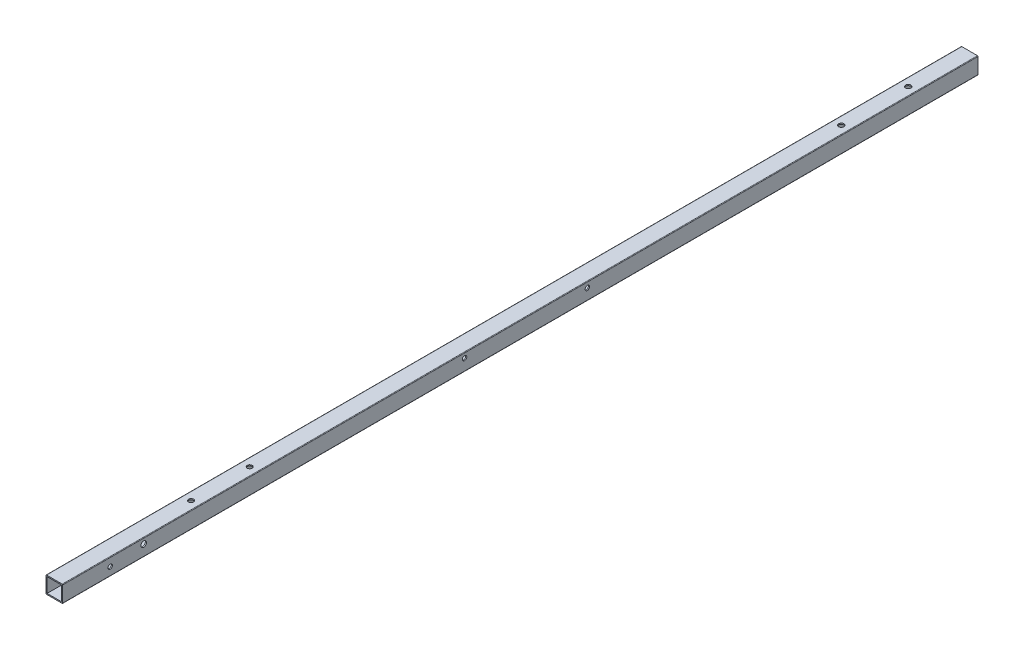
ISO-10303-21;
HEADER;
FILE_DESCRIPTION(('STEP AP214'),'2;1');
FILE_NAME('part.step','',(''),(''),'','','');
FILE_SCHEMA(('AUTOMOTIVE_DESIGN { 1 0 10303 214 1 1 1 1 }'));
ENDSEC;
DATA;
#1=APPLICATION_CONTEXT('core data for automotive mechanical design processes');
#2=APPLICATION_PROTOCOL_DEFINITION('international standard','automotive_design',2000,#1);
#3=PRODUCT_CONTEXT('',#1,'mechanical');
#4=PRODUCT('Part','Part','',(#3));
#5=PRODUCT_RELATED_PRODUCT_CATEGORY('part','',(#4));
#6=PRODUCT_DEFINITION_FORMATION('','',#4);
#7=PRODUCT_DEFINITION_CONTEXT('part definition',#1,'design');
#8=PRODUCT_DEFINITION('design','',#6,#7);
#9=PRODUCT_DEFINITION_SHAPE('','',#8);
#10=(LENGTH_UNIT() NAMED_UNIT(*) SI_UNIT(.MILLI.,.METRE.));
#11=(NAMED_UNIT(*) PLANE_ANGLE_UNIT() SI_UNIT($,.RADIAN.));
#12=(NAMED_UNIT(*) SI_UNIT($,.STERADIAN.) SOLID_ANGLE_UNIT());
#13=UNCERTAINTY_MEASURE_WITH_UNIT(LENGTH_MEASURE(1.E-05),#10,'distance_accuracy_value','');
#14=(GEOMETRIC_REPRESENTATION_CONTEXT(3) GLOBAL_UNCERTAINTY_ASSIGNED_CONTEXT((#13)) GLOBAL_UNIT_ASSIGNED_CONTEXT((#10,
#11,#12)) REPRESENTATION_CONTEXT('',''));
#15=CARTESIAN_POINT('',(0.,0.,0.));
#16=DIRECTION('',(0.,0.,1.));
#17=DIRECTION('',(1.,0.,0.));
#18=AXIS2_PLACEMENT_3D('',#15,#16,#17);
#19=CARTESIAN_POINT('',(-14.,-13.,1640.));
#20=DIRECTION('',(0.,-1.,0.));
#21=DIRECTION('',(1.,0.,0.));
#22=AXIS2_PLACEMENT_3D('',#19,#20,#21);
#23=PLANE('',#22);
#24=CARTESIAN_POINT('',(0.,-13.,150.));
#25=DIRECTION('',(0.,-1.,0.));
#26=DIRECTION('',(1.,0.,0.));
#27=AXIS2_PLACEMENT_3D('',#24,#25,#26);
#28=CIRCLE('',#27,4.75);
#29=CARTESIAN_POINT('',(4.75,-13.,150.));
#30=VERTEX_POINT('',#29);
#31=EDGE_CURVE('E418',#30,#30,#28,.F.);
#32=ORIENTED_EDGE('',*,*,#31,.F.);
#33=EDGE_LOOP('',(#32));
#34=FACE_BOUND('',#33,.T.);
#35=CARTESIAN_POINT('',(0.,-13.,1395.));
#36=DIRECTION('',(0.,-1.,0.));
#37=DIRECTION('',(1.,0.,0.));
#38=AXIS2_PLACEMENT_3D('',#35,#36,#37);
#39=CIRCLE('',#38,4.49999999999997);
#40=CARTESIAN_POINT('',(0.,-13.,1399.5));
#41=VERTEX_POINT('',#40);
#42=EDGE_CURVE('E236',#41,#41,#39,.T.);
#43=ORIENTED_EDGE('',*,*,#42,.T.);
#44=EDGE_LOOP('',(#43));
#45=FACE_BOUND('',#44,.T.);
#46=CARTESIAN_POINT('',(0.,-13.,1290.));
#47=DIRECTION('',(0.,-1.,0.));
#48=DIRECTION('',(1.,0.,0.));
#49=AXIS2_PLACEMENT_3D('',#46,#47,#48);
#50=CIRCLE('',#49,4.49999999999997);
#51=CARTESIAN_POINT('',(0.,-13.,1294.5));
#52=VERTEX_POINT('',#51);
#53=EDGE_CURVE('E231',#52,#52,#50,.T.);
#54=ORIENTED_EDGE('',*,*,#53,.T.);
#55=EDGE_LOOP('',(#54));
#56=FACE_BOUND('',#55,.T.);
#57=CARTESIAN_POINT('',(0.,-13.,230.));
#58=DIRECTION('',(0.,-1.,0.));
#59=DIRECTION('',(1.,0.,0.));
#60=AXIS2_PLACEMENT_3D('',#57,#58,#59);
#61=CIRCLE('',#60,4.75);
#62=CARTESIAN_POINT('',(0.,-13.,234.75));
#63=VERTEX_POINT('',#62);
#64=EDGE_CURVE('E226',#63,#63,#61,.T.);
#65=ORIENTED_EDGE('',*,*,#64,.T.);
#66=EDGE_LOOP('',(#65));
#67=FACE_BOUND('',#66,.T.);
#68=CARTESIAN_POINT('',(0.,-13.,110.));
#69=DIRECTION('',(0.,-1.,0.));
#70=DIRECTION('',(1.,0.,0.));
#71=AXIS2_PLACEMENT_3D('',#68,#69,#70);
#72=CIRCLE('',#71,4.75);
#73=CARTESIAN_POINT('',(0.,-13.,114.75));
#74=VERTEX_POINT('',#73);
#75=EDGE_CURVE('E144',#74,#74,#72,.T.);
#76=ORIENTED_EDGE('',*,*,#75,.T.);
#77=EDGE_LOOP('',(#76));
#78=FACE_BOUND('',#77,.T.);
#79=DIRECTION('',(-1.,0.,0.));
#80=VECTOR('',#79,1.);
#81=CARTESIAN_POINT('',(-14.,-13.,0.));
#82=LINE('',#81,#80);
#83=CARTESIAN_POINT('',(13.,-13.,0.));
#84=VERTEX_POINT('',#83);
#85=CARTESIAN_POINT('',(-13.,-13.,0.));
#86=VERTEX_POINT('',#85);
#87=EDGE_CURVE('E131',#84,#86,#82,.T.);
#88=ORIENTED_EDGE('',*,*,#87,.T.);
#89=DIRECTION('',(0.,0.,-1.));
#90=VECTOR('',#89,1.);
#91=CARTESIAN_POINT('',(-13.,-13.,1640.));
#92=LINE('',#91,#90);
#93=CARTESIAN_POINT('',(-13.,-13.,1640.));
#94=VERTEX_POINT('',#93);
#95=EDGE_CURVE('E119',#94,#86,#92,.T.);
#96=ORIENTED_EDGE('',*,*,#95,.F.);
#97=DIRECTION('',(-1.,0.,0.));
#98=VECTOR('',#97,1.);
#99=CARTESIAN_POINT('',(-14.,-13.,1640.));
#100=LINE('',#99,#98);
#101=CARTESIAN_POINT('',(13.,-13.,1640.));
#102=VERTEX_POINT('',#101);
#103=EDGE_CURVE('E151',#102,#94,#100,.T.);
#104=ORIENTED_EDGE('',*,*,#103,.F.);
#105=DIRECTION('',(0.,0.,-1.));
#106=VECTOR('',#105,1.);
#107=CARTESIAN_POINT('',(13.,-13.,1640.));
#108=LINE('',#107,#106);
#109=EDGE_CURVE('E128',#102,#84,#108,.T.);
#110=ORIENTED_EDGE('',*,*,#109,.T.);
#111=EDGE_LOOP('',(#88,#96,#104,#110));
#112=FACE_BOUND('',#111,.T.);
#113=CARTESIAN_POINT('',(0.,-13.,190.));
#114=DIRECTION('',(0.,-1.,0.));
#115=DIRECTION('',(1.,0.,0.));
#116=AXIS2_PLACEMENT_3D('',#113,#114,#115);
#117=CIRCLE('',#116,4.75);
#118=CARTESIAN_POINT('',(4.75,-13.,190.));
#119=VERTEX_POINT('',#118);
#120=EDGE_CURVE('E410',#119,#119,#117,.F.);
#121=ORIENTED_EDGE('',*,*,#120,.F.);
#122=EDGE_LOOP('',(#121));
#123=FACE_BOUND('',#122,.T.);
#124=ADVANCED_FACE('F30',(#34,#45,#56,#67,#78,#112,#123),#23,.F.);
#125=CARTESIAN_POINT('',(14.,-15.,1640.));
#126=DIRECTION('',(0.,-1.,0.));
#127=DIRECTION('',(1.,0.,0.));
#128=AXIS2_PLACEMENT_3D('',#125,#126,#127);
#129=PLANE('',#128);
#130=CARTESIAN_POINT('',(0.,-15.,150.));
#131=DIRECTION('',(0.,1.,0.));
#132=DIRECTION('',(-1.,0.,0.));
#133=AXIS2_PLACEMENT_3D('',#130,#131,#132);
#134=CIRCLE('',#133,4.75);
#135=CARTESIAN_POINT('',(-4.75000000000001,-15.,150.));
#136=VERTEX_POINT('',#135);
#137=EDGE_CURVE('E413',#136,#136,#134,.T.);
#138=ORIENTED_EDGE('',*,*,#137,.T.);
#139=EDGE_LOOP('',(#138));
#140=FACE_BOUND('',#139,.T.);
#141=CARTESIAN_POINT('',(0.,-15.,1395.));
#142=DIRECTION('',(0.,-1.,0.));
#143=DIRECTION('',(1.,0.,0.));
#144=AXIS2_PLACEMENT_3D('',#141,#142,#143);
#145=CIRCLE('',#144,4.49999999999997);
#146=CARTESIAN_POINT('',(0.,-15.,1399.5));
#147=VERTEX_POINT('',#146);
#148=EDGE_CURVE('E286',#147,#147,#145,.T.);
#149=ORIENTED_EDGE('',*,*,#148,.F.);
#150=EDGE_LOOP('',(#149));
#151=FACE_BOUND('',#150,.T.);
#152=CARTESIAN_POINT('',(0.,-15.,1290.));
#153=DIRECTION('',(0.,-1.,0.));
#154=DIRECTION('',(1.,0.,0.));
#155=AXIS2_PLACEMENT_3D('',#152,#153,#154);
#156=CIRCLE('',#155,4.49999999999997);
#157=CARTESIAN_POINT('',(0.,-15.,1294.5));
#158=VERTEX_POINT('',#157);
#159=EDGE_CURVE('E293',#158,#158,#156,.T.);
#160=ORIENTED_EDGE('',*,*,#159,.F.);
#161=EDGE_LOOP('',(#160));
#162=FACE_BOUND('',#161,.T.);
#163=CARTESIAN_POINT('',(0.,-15.,230.));
#164=DIRECTION('',(0.,-1.,0.));
#165=DIRECTION('',(1.,0.,0.));
#166=AXIS2_PLACEMENT_3D('',#163,#164,#165);
#167=CIRCLE('',#166,4.75);
#168=CARTESIAN_POINT('',(0.,-15.,234.75));
#169=VERTEX_POINT('',#168);
#170=EDGE_CURVE('E300',#169,#169,#167,.T.);
#171=ORIENTED_EDGE('',*,*,#170,.F.);
#172=EDGE_LOOP('',(#171));
#173=FACE_BOUND('',#172,.T.);
#174=CARTESIAN_POINT('',(0.,-15.,110.));
#175=DIRECTION('',(0.,-1.,0.));
#176=DIRECTION('',(1.,0.,0.));
#177=AXIS2_PLACEMENT_3D('',#174,#175,#176);
#178=CIRCLE('',#177,4.75);
#179=CARTESIAN_POINT('',(0.,-15.,114.75));
#180=VERTEX_POINT('',#179);
#181=EDGE_CURVE('E141',#180,#180,#178,.T.);
#182=ORIENTED_EDGE('',*,*,#181,.F.);
#183=EDGE_LOOP('',(#182));
#184=FACE_BOUND('',#183,.T.);
#185=DIRECTION('',(-1.,0.,0.));
#186=VECTOR('',#185,1.);
#187=CARTESIAN_POINT('',(14.,-15.,0.));
#188=LINE('',#187,#186);
#189=CARTESIAN_POINT('',(14.,-15.,0.));
#190=VERTEX_POINT('',#189);
#191=CARTESIAN_POINT('',(-14.,-15.,0.));
#192=VERTEX_POINT('',#191);
#193=EDGE_CURVE('E181',#190,#192,#188,.T.);
#194=ORIENTED_EDGE('',*,*,#193,.F.);
#195=DIRECTION('',(0.,0.,-1.));
#196=VECTOR('',#195,1.);
#197=CARTESIAN_POINT('',(14.,-15.,1640.));
#198=LINE('',#197,#196);
#199=CARTESIAN_POINT('',(14.,-15.,1640.));
#200=VERTEX_POINT('',#199);
#201=EDGE_CURVE('E39',#200,#190,#198,.T.);
#202=ORIENTED_EDGE('',*,*,#201,.F.);
#203=DIRECTION('',(-1.,0.,0.));
#204=VECTOR('',#203,1.);
#205=CARTESIAN_POINT('',(14.,-15.,1640.));
#206=LINE('',#205,#204);
#207=CARTESIAN_POINT('',(-14.,-15.,1640.));
#208=VERTEX_POINT('',#207);
#209=EDGE_CURVE('E202',#200,#208,#206,.T.);
#210=ORIENTED_EDGE('',*,*,#209,.T.);
#211=DIRECTION('',(0.,0.,-1.));
#212=VECTOR('',#211,1.);
#213=CARTESIAN_POINT('',(-14.,-15.,1640.));
#214=LINE('',#213,#212);
#215=EDGE_CURVE('E11',#208,#192,#214,.T.);
#216=ORIENTED_EDGE('',*,*,#215,.T.);
#217=EDGE_LOOP('',(#194,#202,#210,#216));
#218=FACE_BOUND('',#217,.T.);
#219=CARTESIAN_POINT('',(0.,-15.,190.));
#220=DIRECTION('',(0.,1.,0.));
#221=DIRECTION('',(-1.,0.,0.));
#222=AXIS2_PLACEMENT_3D('',#219,#220,#221);
#223=CIRCLE('',#222,4.75);
#224=CARTESIAN_POINT('',(-4.75000000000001,-15.,190.));
#225=VERTEX_POINT('',#224);
#226=EDGE_CURVE('E408',#225,#225,#223,.T.);
#227=ORIENTED_EDGE('',*,*,#226,.T.);
#228=EDGE_LOOP('',(#227));
#229=FACE_BOUND('',#228,.T.);
#230=ADVANCED_FACE('F325',(#140,#151,#162,#173,#184,#218,#229),#129,.T.);
#231=CARTESIAN_POINT('',(-14.,-14.,0.));
#232=DIRECTION('',(0.,0.,-1.));
#233=DIRECTION('',(-1.,0.,0.));
#234=AXIS2_PLACEMENT_3D('',#231,#232,#233);
#235=PLANE('',#234);
#236=CARTESIAN_POINT('',(-14.,-14.,0.));
#237=DIRECTION('',(0.,0.,-1.));
#238=DIRECTION('',(-1.,0.,0.));
#239=AXIS2_PLACEMENT_3D('',#236,#237,#238);
#240=CIRCLE('',#239,0.999999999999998);
#241=CARTESIAN_POINT('',(-15.,-14.,0.));
#242=VERTEX_POINT('',#241);
#243=EDGE_CURVE('E127',#192,#242,#240,.T.);
#244=ORIENTED_EDGE('',*,*,#243,.T.);
#245=DIRECTION('',(0.,-1.,0.));
#246=VECTOR('',#245,1.);
#247=CARTESIAN_POINT('',(-15.,14.,0.));
#248=LINE('',#247,#246);
#249=CARTESIAN_POINT('',(-15.,14.,0.));
#250=VERTEX_POINT('',#249);
#251=EDGE_CURVE('E164',#250,#242,#248,.T.);
#252=ORIENTED_EDGE('',*,*,#251,.F.);
#253=CARTESIAN_POINT('',(-14.,14.,0.));
#254=DIRECTION('',(0.,0.,-1.));
#255=DIRECTION('',(-1.,0.,0.));
#256=AXIS2_PLACEMENT_3D('',#253,#254,#255);
#257=CIRCLE('',#256,0.999999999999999);
#258=CARTESIAN_POINT('',(-14.,15.,0.));
#259=VERTEX_POINT('',#258);
#260=EDGE_CURVE('E167',#250,#259,#257,.T.);
#261=ORIENTED_EDGE('',*,*,#260,.T.);
#262=DIRECTION('',(1.,0.,0.));
#263=VECTOR('',#262,1.);
#264=CARTESIAN_POINT('',(-14.,15.,0.));
#265=LINE('',#264,#263);
#266=CARTESIAN_POINT('',(14.,15.,0.));
#267=VERTEX_POINT('',#266);
#268=EDGE_CURVE('E170',#259,#267,#265,.T.);
#269=ORIENTED_EDGE('',*,*,#268,.T.);
#270=CARTESIAN_POINT('',(14.,14.,0.));
#271=DIRECTION('',(0.,0.,1.));
#272=DIRECTION('',(1.,0.,0.));
#273=AXIS2_PLACEMENT_3D('',#270,#271,#272);
#274=CIRCLE('',#273,0.999999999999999);
#275=CARTESIAN_POINT('',(15.,14.,0.));
#276=VERTEX_POINT('',#275);
#277=EDGE_CURVE('E173',#276,#267,#274,.T.);
#278=ORIENTED_EDGE('',*,*,#277,.F.);
#279=DIRECTION('',(0.,1.,0.));
#280=VECTOR('',#279,1.);
#281=CARTESIAN_POINT('',(15.,-14.,0.));
#282=LINE('',#281,#280);
#283=CARTESIAN_POINT('',(15.,-14.,0.));
#284=VERTEX_POINT('',#283);
#285=EDGE_CURVE('E176',#284,#276,#282,.T.);
#286=ORIENTED_EDGE('',*,*,#285,.F.);
#287=CARTESIAN_POINT('',(14.,-14.,0.));
#288=DIRECTION('',(0.,0.,-1.));
#289=DIRECTION('',(-1.,0.,0.));
#290=AXIS2_PLACEMENT_3D('',#287,#288,#289);
#291=CIRCLE('',#290,1.);
#292=EDGE_CURVE('E178',#284,#190,#291,.T.);
#293=ORIENTED_EDGE('',*,*,#292,.T.);
#294=ORIENTED_EDGE('',*,*,#193,.T.);
#295=EDGE_LOOP('',(#244,#252,#261,#269,#278,#286,#293,#294));
#296=FACE_BOUND('',#295,.T.);
#297=DIRECTION('',(1.,0.,0.));
#298=VECTOR('',#297,1.);
#299=CARTESIAN_POINT('',(-14.,13.,0.));
#300=LINE('',#299,#298);
#301=CARTESIAN_POINT('',(-13.,13.,0.));
#302=VERTEX_POINT('',#301);
#303=CARTESIAN_POINT('',(13.,13.,0.));
#304=VERTEX_POINT('',#303);
#305=EDGE_CURVE('E140',#302,#304,#300,.T.);
#306=ORIENTED_EDGE('',*,*,#305,.F.);
#307=DIRECTION('',(0.,-1.,0.));
#308=VECTOR('',#307,1.);
#309=CARTESIAN_POINT('',(-13.,-14.,0.));
#310=LINE('',#309,#308);
#311=EDGE_CURVE('E55',#302,#86,#310,.T.);
#312=ORIENTED_EDGE('',*,*,#311,.T.);
#313=ORIENTED_EDGE('',*,*,#87,.F.);
#314=DIRECTION('',(0.,1.,0.));
#315=VECTOR('',#314,1.);
#316=CARTESIAN_POINT('',(13.,-14.,0.));
#317=LINE('',#316,#315);
#318=EDGE_CURVE('E136',#84,#304,#317,.T.);
#319=ORIENTED_EDGE('',*,*,#318,.T.);
#320=EDGE_LOOP('',(#306,#312,#313,#319));
#321=FACE_BOUND('',#320,.T.);
#322=ADVANCED_FACE('F139',(#296,#321),#235,.T.);
#323=CARTESIAN_POINT('',(-14.,-14.,1640.));
#324=DIRECTION('',(0.,0.,-1.));
#325=DIRECTION('',(-1.,0.,0.));
#326=AXIS2_PLACEMENT_3D('',#323,#324,#325);
#327=CYLINDRICAL_SURFACE('',#326,0.999999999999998);
#328=ORIENTED_EDGE('',*,*,#243,.F.);
#329=ORIENTED_EDGE('',*,*,#215,.F.);
#330=CARTESIAN_POINT('',(-14.,-14.,1640.));
#331=DIRECTION('',(0.,0.,-1.));
#332=DIRECTION('',(-1.,0.,0.));
#333=AXIS2_PLACEMENT_3D('',#330,#331,#332);
#334=CIRCLE('',#333,0.999999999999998);
#335=CARTESIAN_POINT('',(-15.,-14.,1640.));
#336=VERTEX_POINT('',#335);
#337=EDGE_CURVE('E184',#208,#336,#334,.T.);
#338=ORIENTED_EDGE('',*,*,#337,.T.);
#339=DIRECTION('',(0.,0.,-1.));
#340=VECTOR('',#339,1.);
#341=CARTESIAN_POINT('',(-15.,-14.,1640.));
#342=LINE('',#341,#340);
#343=EDGE_CURVE('E204',#336,#242,#342,.T.);
#344=ORIENTED_EDGE('',*,*,#343,.T.);
#345=EDGE_LOOP('',(#328,#329,#338,#344));
#346=FACE_BOUND('',#345,.T.);
#347=ADVANCED_FACE('F32',(#346),#327,.T.);
#348=CARTESIAN_POINT('',(14.,-14.,1640.));
#349=DIRECTION('',(0.,0.,-1.));
#350=DIRECTION('',(-1.,0.,0.));
#351=AXIS2_PLACEMENT_3D('',#348,#349,#350);
#352=CYLINDRICAL_SURFACE('',#351,1.);
#353=ORIENTED_EDGE('',*,*,#292,.F.);
#354=DIRECTION('',(0.,0.,-1.));
#355=VECTOR('',#354,1.);
#356=CARTESIAN_POINT('',(15.,-14.,1640.));
#357=LINE('',#356,#355);
#358=CARTESIAN_POINT('',(15.,-14.,1640.));
#359=VERTEX_POINT('',#358);
#360=EDGE_CURVE('E207',#359,#284,#357,.T.);
#361=ORIENTED_EDGE('',*,*,#360,.F.);
#362=CARTESIAN_POINT('',(14.,-14.,1640.));
#363=DIRECTION('',(0.,0.,-1.));
#364=DIRECTION('',(-1.,0.,0.));
#365=AXIS2_PLACEMENT_3D('',#362,#363,#364);
#366=CIRCLE('',#365,1.);
#367=EDGE_CURVE('E199',#359,#200,#366,.T.);
#368=ORIENTED_EDGE('',*,*,#367,.T.);
#369=ORIENTED_EDGE('',*,*,#201,.T.);
#370=EDGE_LOOP('',(#353,#361,#368,#369));
#371=FACE_BOUND('',#370,.T.);
#372=ADVANCED_FACE('F349',(#371),#352,.T.);
#373=CARTESIAN_POINT('',(15.,-14.,1640.));
#374=DIRECTION('',(-1.,0.,0.));
#375=DIRECTION('',(0.,-1.,0.));
#376=AXIS2_PLACEMENT_3D('',#373,#374,#375);
#377=PLANE('',#376);
#378=CARTESIAN_POINT('',(15.,6.,920.));
#379=DIRECTION('',(-1.,0.,0.));
#380=DIRECTION('',(0.,-1.,0.));
#381=AXIS2_PLACEMENT_3D('',#378,#379,#380);
#382=CIRCLE('',#381,3.99999999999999);
#383=CARTESIAN_POINT('',(15.,2.,920.));
#384=VERTEX_POINT('',#383);
#385=EDGE_CURVE('E257',#384,#384,#382,.T.);
#386=ORIENTED_EDGE('',*,*,#385,.T.);
#387=EDGE_LOOP('',(#386));
#388=FACE_BOUND('',#387,.T.);
#389=CARTESIAN_POINT('',(15.,4.99999999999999,700.002272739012));
#390=DIRECTION('',(-1.,0.,0.));
#391=DIRECTION('',(0.,-1.,0.));
#392=AXIS2_PLACEMENT_3D('',#389,#390,#391);
#393=CIRCLE('',#392,3.99999999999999);
#394=CARTESIAN_POINT('',(15.,1.,700.002272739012));
#395=VERTEX_POINT('',#394);
#396=EDGE_CURVE('E254',#395,#395,#393,.T.);
#397=ORIENTED_EDGE('',*,*,#396,.T.);
#398=EDGE_LOOP('',(#397));
#399=FACE_BOUND('',#398,.T.);
#400=CARTESIAN_POINT('',(15.,5.,1495.));
#401=DIRECTION('',(-1.,0.,0.));
#402=DIRECTION('',(0.,-1.,0.));
#403=AXIS2_PLACEMENT_3D('',#400,#401,#402);
#404=CIRCLE('',#403,4.99999999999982);
#405=CARTESIAN_POINT('',(15.,1.7886238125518E-13,1495.));
#406=VERTEX_POINT('',#405);
#407=EDGE_CURVE('E272',#406,#406,#404,.T.);
#408=ORIENTED_EDGE('',*,*,#407,.T.);
#409=EDGE_LOOP('',(#408));
#410=FACE_BOUND('',#409,.T.);
#411=CARTESIAN_POINT('',(15.,0.,1555.));
#412=DIRECTION('',(-1.,0.,0.));
#413=DIRECTION('',(0.,-1.,0.));
#414=AXIS2_PLACEMENT_3D('',#411,#412,#413);
#415=CIRCLE('',#414,3.99999999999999);
#416=CARTESIAN_POINT('',(15.,-3.99999999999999,1555.));
#417=VERTEX_POINT('',#416);
#418=EDGE_CURVE('E279',#417,#417,#415,.T.);
#419=ORIENTED_EDGE('',*,*,#418,.T.);
#420=EDGE_LOOP('',(#419));
#421=FACE_BOUND('',#420,.T.);
#422=ORIENTED_EDGE('',*,*,#285,.T.);
#423=DIRECTION('',(0.,0.,-1.));
#424=VECTOR('',#423,1.);
#425=CARTESIAN_POINT('',(15.,14.,1640.));
#426=LINE('',#425,#424);
#427=CARTESIAN_POINT('',(15.,14.,1640.));
#428=VERTEX_POINT('',#427);
#429=EDGE_CURVE('E209',#428,#276,#426,.T.);
#430=ORIENTED_EDGE('',*,*,#429,.F.);
#431=DIRECTION('',(0.,1.,0.));
#432=VECTOR('',#431,1.);
#433=CARTESIAN_POINT('',(15.,-14.,1640.));
#434=LINE('',#433,#432);
#435=EDGE_CURVE('E197',#359,#428,#434,.T.);
#436=ORIENTED_EDGE('',*,*,#435,.F.);
#437=ORIENTED_EDGE('',*,*,#360,.T.);
#438=EDGE_LOOP('',(#422,#430,#436,#437));
#439=FACE_BOUND('',#438,.T.);
#440=ADVANCED_FACE('F352',(#388,#399,#410,#421,#439),#377,.F.);
#441=CARTESIAN_POINT('',(14.,14.,1640.));
#442=DIRECTION('',(0.,0.,-1.));
#443=DIRECTION('',(-1.,0.,0.));
#444=AXIS2_PLACEMENT_3D('',#441,#442,#443);
#445=CYLINDRICAL_SURFACE('',#444,0.999999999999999);
#446=ORIENTED_EDGE('',*,*,#277,.T.);
#447=DIRECTION('',(0.,0.,-1.));
#448=VECTOR('',#447,1.);
#449=CARTESIAN_POINT('',(14.,15.,1640.));
#450=LINE('',#449,#448);
#451=CARTESIAN_POINT('',(14.,15.,1640.));
#452=VERTEX_POINT('',#451);
#453=EDGE_CURVE('E212',#452,#267,#450,.T.);
#454=ORIENTED_EDGE('',*,*,#453,.F.);
#455=CARTESIAN_POINT('',(14.,14.,1640.));
#456=DIRECTION('',(0.,0.,1.));
#457=DIRECTION('',(1.,0.,0.));
#458=AXIS2_PLACEMENT_3D('',#455,#456,#457);
#459=CIRCLE('',#458,0.999999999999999);
#460=EDGE_CURVE('E195',#428,#452,#459,.T.);
#461=ORIENTED_EDGE('',*,*,#460,.F.);
#462=ORIENTED_EDGE('',*,*,#429,.T.);
#463=EDGE_LOOP('',(#446,#454,#461,#462));
#464=FACE_BOUND('',#463,.T.);
#465=ADVANCED_FACE('F356',(#464),#445,.T.);
#466=CARTESIAN_POINT('',(-14.,15.,1640.));
#467=DIRECTION('',(0.,1.,0.));
#468=DIRECTION('',(0.,0.,1.));
#469=AXIS2_PLACEMENT_3D('',#466,#467,#468);
#470=PLANE('',#469);
#471=CARTESIAN_POINT('',(0.,15.,1395.));
#472=DIRECTION('',(0.,1.,0.));
#473=DIRECTION('',(0.,0.,1.));
#474=AXIS2_PLACEMENT_3D('',#471,#472,#473);
#475=CIRCLE('',#474,4.49999999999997);
#476=CARTESIAN_POINT('',(0.,15.,1399.5));
#477=VERTEX_POINT('',#476);
#478=EDGE_CURVE('E237',#477,#477,#475,.T.);
#479=ORIENTED_EDGE('',*,*,#478,.F.);
#480=EDGE_LOOP('',(#479));
#481=FACE_BOUND('',#480,.T.);
#482=CARTESIAN_POINT('',(0.,15.,1290.));
#483=DIRECTION('',(0.,1.,0.));
#484=DIRECTION('',(0.,0.,1.));
#485=AXIS2_PLACEMENT_3D('',#482,#483,#484);
#486=CIRCLE('',#485,4.49999999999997);
#487=CARTESIAN_POINT('',(0.,15.,1294.5));
#488=VERTEX_POINT('',#487);
#489=EDGE_CURVE('E232',#488,#488,#486,.T.);
#490=ORIENTED_EDGE('',*,*,#489,.F.);
#491=EDGE_LOOP('',(#490));
#492=FACE_BOUND('',#491,.T.);
#493=CARTESIAN_POINT('',(0.,15.,230.));
#494=DIRECTION('',(0.,1.,0.));
#495=DIRECTION('',(0.,0.,1.));
#496=AXIS2_PLACEMENT_3D('',#493,#494,#495);
#497=CIRCLE('',#496,4.75);
#498=CARTESIAN_POINT('',(0.,15.,234.75));
#499=VERTEX_POINT('',#498);
#500=EDGE_CURVE('E227',#499,#499,#497,.T.);
#501=ORIENTED_EDGE('',*,*,#500,.F.);
#502=EDGE_LOOP('',(#501));
#503=FACE_BOUND('',#502,.T.);
#504=CARTESIAN_POINT('',(0.,15.,110.));
#505=DIRECTION('',(0.,1.,0.));
#506=DIRECTION('',(0.,0.,1.));
#507=AXIS2_PLACEMENT_3D('',#504,#505,#506);
#508=CIRCLE('',#507,4.75);
#509=CARTESIAN_POINT('',(0.,15.,114.75));
#510=VERTEX_POINT('',#509);
#511=EDGE_CURVE('E222',#510,#510,#508,.T.);
#512=ORIENTED_EDGE('',*,*,#511,.F.);
#513=EDGE_LOOP('',(#512));
#514=FACE_BOUND('',#513,.T.);
#515=ORIENTED_EDGE('',*,*,#268,.F.);
#516=DIRECTION('',(0.,0.,-1.));
#517=VECTOR('',#516,1.);
#518=CARTESIAN_POINT('',(-14.,15.,1640.));
#519=LINE('',#518,#517);
#520=CARTESIAN_POINT('',(-14.,15.,1640.));
#521=VERTEX_POINT('',#520);
#522=EDGE_CURVE('E214',#521,#259,#519,.T.);
#523=ORIENTED_EDGE('',*,*,#522,.F.);
#524=DIRECTION('',(1.,0.,0.));
#525=VECTOR('',#524,1.);
#526=CARTESIAN_POINT('',(-14.,15.,1640.));
#527=LINE('',#526,#525);
#528=EDGE_CURVE('E192',#521,#452,#527,.T.);
#529=ORIENTED_EDGE('',*,*,#528,.T.);
#530=ORIENTED_EDGE('',*,*,#453,.T.);
#531=EDGE_LOOP('',(#515,#523,#529,#530));
#532=FACE_BOUND('',#531,.T.);
#533=ADVANCED_FACE('F360',(#481,#492,#503,#514,#532),#470,.T.);
#534=CARTESIAN_POINT('',(-14.,14.,1640.));
#535=DIRECTION('',(0.,0.,-1.));
#536=DIRECTION('',(-1.,0.,0.));
#537=AXIS2_PLACEMENT_3D('',#534,#535,#536);
#538=CYLINDRICAL_SURFACE('',#537,0.999999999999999);
#539=ORIENTED_EDGE('',*,*,#260,.F.);
#540=DIRECTION('',(0.,0.,-1.));
#541=VECTOR('',#540,1.);
#542=CARTESIAN_POINT('',(-15.,14.,1640.));
#543=LINE('',#542,#541);
#544=CARTESIAN_POINT('',(-15.,14.,1640.));
#545=VERTEX_POINT('',#544);
#546=EDGE_CURVE('E216',#545,#250,#543,.T.);
#547=ORIENTED_EDGE('',*,*,#546,.F.);
#548=CARTESIAN_POINT('',(-14.,14.,1640.));
#549=DIRECTION('',(0.,0.,-1.));
#550=DIRECTION('',(-1.,0.,0.));
#551=AXIS2_PLACEMENT_3D('',#548,#549,#550);
#552=CIRCLE('',#551,0.999999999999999);
#553=EDGE_CURVE('E189',#545,#521,#552,.T.);
#554=ORIENTED_EDGE('',*,*,#553,.T.);
#555=ORIENTED_EDGE('',*,*,#522,.T.);
#556=EDGE_LOOP('',(#539,#547,#554,#555));
#557=FACE_BOUND('',#556,.T.);
#558=ADVANCED_FACE('F364',(#557),#538,.T.);
#559=CARTESIAN_POINT('',(-15.,14.,1640.));
#560=DIRECTION('',(1.,0.,0.));
#561=DIRECTION('',(0.,1.,0.));
#562=AXIS2_PLACEMENT_3D('',#559,#560,#561);
#563=PLANE('',#562);
#564=CARTESIAN_POINT('',(-15.,6.,920.));
#565=DIRECTION('',(-1.,0.,0.));
#566=DIRECTION('',(0.,-1.,0.));
#567=AXIS2_PLACEMENT_3D('',#564,#565,#566);
#568=CIRCLE('',#567,3.99999999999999);
#569=CARTESIAN_POINT('',(-15.,2.00000000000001,920.));
#570=VERTEX_POINT('',#569);
#571=EDGE_CURVE('E375',#570,#570,#568,.T.);
#572=ORIENTED_EDGE('',*,*,#571,.F.);
#573=EDGE_LOOP('',(#572));
#574=FACE_BOUND('',#573,.T.);
#575=CARTESIAN_POINT('',(-15.,5.,700.002272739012));
#576=DIRECTION('',(-1.,0.,0.));
#577=DIRECTION('',(0.,-1.,0.));
#578=AXIS2_PLACEMENT_3D('',#575,#576,#577);
#579=CIRCLE('',#578,3.99999999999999);
#580=CARTESIAN_POINT('',(-15.,1.00000000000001,700.002272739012));
#581=VERTEX_POINT('',#580);
#582=EDGE_CURVE('E250',#581,#581,#579,.T.);
#583=ORIENTED_EDGE('',*,*,#582,.F.);
#584=EDGE_LOOP('',(#583));
#585=FACE_BOUND('',#584,.T.);
#586=CARTESIAN_POINT('',(-15.,5.00000000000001,1495.));
#587=DIRECTION('',(-1.,0.,0.));
#588=DIRECTION('',(0.,-1.,0.));
#589=AXIS2_PLACEMENT_3D('',#586,#587,#588);
#590=CIRCLE('',#589,4.99999999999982);
#591=CARTESIAN_POINT('',(-15.,1.8474805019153E-13,1495.));
#592=VERTEX_POINT('',#591);
#593=EDGE_CURVE('E246',#592,#592,#590,.T.);
#594=ORIENTED_EDGE('',*,*,#593,.F.);
#595=EDGE_LOOP('',(#594));
#596=FACE_BOUND('',#595,.T.);
#597=CARTESIAN_POINT('',(-15.,0.,1555.));
#598=DIRECTION('',(-1.,0.,0.));
#599=DIRECTION('',(0.,-1.,0.));
#600=AXIS2_PLACEMENT_3D('',#597,#598,#599);
#601=CIRCLE('',#600,3.99999999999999);
#602=CARTESIAN_POINT('',(-15.,-3.99999999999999,1555.));
#603=VERTEX_POINT('',#602);
#604=EDGE_CURVE('E242',#603,#603,#601,.T.);
#605=ORIENTED_EDGE('',*,*,#604,.F.);
#606=EDGE_LOOP('',(#605));
#607=FACE_BOUND('',#606,.T.);
#608=ORIENTED_EDGE('',*,*,#251,.T.);
#609=ORIENTED_EDGE('',*,*,#343,.F.);
#610=DIRECTION('',(0.,-1.,0.));
#611=VECTOR('',#610,1.);
#612=CARTESIAN_POINT('',(-15.,14.,1640.));
#613=LINE('',#612,#611);
#614=EDGE_CURVE('E187',#545,#336,#613,.T.);
#615=ORIENTED_EDGE('',*,*,#614,.F.);
#616=ORIENTED_EDGE('',*,*,#546,.T.);
#617=EDGE_LOOP('',(#608,#609,#615,#616));
#618=FACE_BOUND('',#617,.T.);
#619=ADVANCED_FACE('F346',(#574,#585,#596,#607,#618),#563,.F.);
#620=CARTESIAN_POINT('',(-14.,-14.,1640.));
#621=DIRECTION('',(0.,0.,-1.));
#622=DIRECTION('',(-1.,0.,0.));
#623=AXIS2_PLACEMENT_3D('',#620,#621,#622);
#624=PLANE('',#623);
#625=DIRECTION('',(0.,1.,0.));
#626=VECTOR('',#625,1.);
#627=CARTESIAN_POINT('',(13.,-14.,1640.));
#628=LINE('',#627,#626);
#629=CARTESIAN_POINT('',(13.,13.,1640.));
#630=VERTEX_POINT('',#629);
#631=EDGE_CURVE('E153',#102,#630,#628,.T.);
#632=ORIENTED_EDGE('',*,*,#631,.F.);
#633=ORIENTED_EDGE('',*,*,#103,.T.);
#634=DIRECTION('',(0.,-1.,0.));
#635=VECTOR('',#634,1.);
#636=CARTESIAN_POINT('',(-13.,-14.,1640.));
#637=LINE('',#636,#635);
#638=CARTESIAN_POINT('',(-13.,13.,1640.));
#639=VERTEX_POINT('',#638);
#640=EDGE_CURVE('E123',#639,#94,#637,.T.);
#641=ORIENTED_EDGE('',*,*,#640,.F.);
#642=DIRECTION('',(1.,0.,0.));
#643=VECTOR('',#642,1.);
#644=CARTESIAN_POINT('',(-14.,13.,1640.));
#645=LINE('',#644,#643);
#646=EDGE_CURVE('E155',#639,#630,#645,.T.);
#647=ORIENTED_EDGE('',*,*,#646,.T.);
#648=EDGE_LOOP('',(#632,#633,#641,#647));
#649=FACE_BOUND('',#648,.T.);
#650=ORIENTED_EDGE('',*,*,#337,.F.);
#651=ORIENTED_EDGE('',*,*,#209,.F.);
#652=ORIENTED_EDGE('',*,*,#367,.F.);
#653=ORIENTED_EDGE('',*,*,#435,.T.);
#654=ORIENTED_EDGE('',*,*,#460,.T.);
#655=ORIENTED_EDGE('',*,*,#528,.F.);
#656=ORIENTED_EDGE('',*,*,#553,.F.);
#657=ORIENTED_EDGE('',*,*,#614,.T.);
#658=EDGE_LOOP('',(#650,#651,#652,#653,#654,#655,#656,#657));
#659=FACE_BOUND('',#658,.T.);
#660=ADVANCED_FACE('F340',(#649,#659),#624,.F.);
#661=CARTESIAN_POINT('',(-13.,-14.,1640.));
#662=DIRECTION('',(1.,0.,0.));
#663=DIRECTION('',(0.,1.,0.));
#664=AXIS2_PLACEMENT_3D('',#661,#662,#663);
#665=PLANE('',#664);
#666=CARTESIAN_POINT('',(-13.,6.,920.));
#667=DIRECTION('',(1.,0.,0.));
#668=DIRECTION('',(0.,1.,0.));
#669=AXIS2_PLACEMENT_3D('',#666,#667,#668);
#670=CIRCLE('',#669,3.99999999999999);
#671=CARTESIAN_POINT('',(-13.,9.99999999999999,920.));
#672=VERTEX_POINT('',#671);
#673=EDGE_CURVE('E262',#672,#672,#670,.T.);
#674=ORIENTED_EDGE('',*,*,#673,.F.);
#675=EDGE_LOOP('',(#674));
#676=FACE_BOUND('',#675,.T.);
#677=CARTESIAN_POINT('',(-13.,5.,700.002272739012));
#678=DIRECTION('',(1.,0.,0.));
#679=DIRECTION('',(0.,1.,0.));
#680=AXIS2_PLACEMENT_3D('',#677,#678,#679);
#681=CIRCLE('',#680,3.99999999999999);
#682=CARTESIAN_POINT('',(-13.,8.99999999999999,700.002272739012));
#683=VERTEX_POINT('',#682);
#684=EDGE_CURVE('E249',#683,#683,#681,.T.);
#685=ORIENTED_EDGE('',*,*,#684,.F.);
#686=EDGE_LOOP('',(#685));
#687=FACE_BOUND('',#686,.T.);
#688=CARTESIAN_POINT('',(-13.,5.00000000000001,1495.));
#689=DIRECTION('',(1.,0.,0.));
#690=DIRECTION('',(0.,1.,0.));
#691=AXIS2_PLACEMENT_3D('',#688,#689,#690);
#692=CIRCLE('',#691,4.99999999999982);
#693=CARTESIAN_POINT('',(-13.,9.99999999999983,1495.));
#694=VERTEX_POINT('',#693);
#695=EDGE_CURVE('E245',#694,#694,#692,.T.);
#696=ORIENTED_EDGE('',*,*,#695,.F.);
#697=EDGE_LOOP('',(#696));
#698=FACE_BOUND('',#697,.T.);
#699=CARTESIAN_POINT('',(-13.,0.,1555.));
#700=DIRECTION('',(1.,0.,0.));
#701=DIRECTION('',(0.,1.,0.));
#702=AXIS2_PLACEMENT_3D('',#699,#700,#701);
#703=CIRCLE('',#702,3.99999999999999);
#704=CARTESIAN_POINT('',(-13.,3.99999999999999,1555.));
#705=VERTEX_POINT('',#704);
#706=EDGE_CURVE('E241',#705,#705,#703,.T.);
#707=ORIENTED_EDGE('',*,*,#706,.F.);
#708=EDGE_LOOP('',(#707));
#709=FACE_BOUND('',#708,.T.);
#710=ORIENTED_EDGE('',*,*,#311,.F.);
#711=DIRECTION('',(0.,0.,-1.));
#712=VECTOR('',#711,1.);
#713=CARTESIAN_POINT('',(-13.,13.,1640.));
#714=LINE('',#713,#712);
#715=EDGE_CURVE('E158',#639,#302,#714,.T.);
#716=ORIENTED_EDGE('',*,*,#715,.F.);
#717=ORIENTED_EDGE('',*,*,#640,.T.);
#718=ORIENTED_EDGE('',*,*,#95,.T.);
#719=EDGE_LOOP('',(#710,#716,#717,#718));
#720=FACE_BOUND('',#719,.T.);
#721=ADVANCED_FACE('F121',(#676,#687,#698,#709,#720),#665,.T.);
#722=CARTESIAN_POINT('',(13.,-14.,1640.));
#723=DIRECTION('',(-1.,0.,0.));
#724=DIRECTION('',(0.,-1.,0.));
#725=AXIS2_PLACEMENT_3D('',#722,#723,#724);
#726=PLANE('',#725);
#727=CARTESIAN_POINT('',(13.,6.,920.));
#728=DIRECTION('',(-1.,0.,0.));
#729=DIRECTION('',(0.,-1.,0.));
#730=AXIS2_PLACEMENT_3D('',#727,#728,#729);
#731=CIRCLE('',#730,3.99999999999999);
#732=CARTESIAN_POINT('',(13.,2.,920.));
#733=VERTEX_POINT('',#732);
#734=EDGE_CURVE('E34',#733,#733,#731,.T.);
#735=ORIENTED_EDGE('',*,*,#734,.F.);
#736=EDGE_LOOP('',(#735));
#737=FACE_BOUND('',#736,.T.);
#738=CARTESIAN_POINT('',(13.,4.99999999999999,700.002272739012));
#739=DIRECTION('',(-1.,0.,0.));
#740=DIRECTION('',(0.,-1.,0.));
#741=AXIS2_PLACEMENT_3D('',#738,#739,#740);
#742=CIRCLE('',#741,3.99999999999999);
#743=CARTESIAN_POINT('',(13.,1.,700.002272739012));
#744=VERTEX_POINT('',#743);
#745=EDGE_CURVE('E247',#744,#744,#742,.T.);
#746=ORIENTED_EDGE('',*,*,#745,.F.);
#747=EDGE_LOOP('',(#746));
#748=FACE_BOUND('',#747,.T.);
#749=CARTESIAN_POINT('',(13.,5.,1495.));
#750=DIRECTION('',(-1.,0.,0.));
#751=DIRECTION('',(0.,-1.,0.));
#752=AXIS2_PLACEMENT_3D('',#749,#750,#751);
#753=CIRCLE('',#752,4.99999999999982);
#754=CARTESIAN_POINT('',(13.,1.79234107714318E-13,1495.));
#755=VERTEX_POINT('',#754);
#756=EDGE_CURVE('E243',#755,#755,#753,.T.);
#757=ORIENTED_EDGE('',*,*,#756,.F.);
#758=EDGE_LOOP('',(#757));
#759=FACE_BOUND('',#758,.T.);
#760=CARTESIAN_POINT('',(13.,0.,1555.));
#761=DIRECTION('',(-1.,0.,0.));
#762=DIRECTION('',(0.,-1.,0.));
#763=AXIS2_PLACEMENT_3D('',#760,#761,#762);
#764=CIRCLE('',#763,3.99999999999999);
#765=CARTESIAN_POINT('',(13.,-3.99999999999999,1555.));
#766=VERTEX_POINT('',#765);
#767=EDGE_CURVE('E238',#766,#766,#764,.T.);
#768=ORIENTED_EDGE('',*,*,#767,.F.);
#769=EDGE_LOOP('',(#768));
#770=FACE_BOUND('',#769,.T.);
#771=ORIENTED_EDGE('',*,*,#318,.F.);
#772=ORIENTED_EDGE('',*,*,#109,.F.);
#773=ORIENTED_EDGE('',*,*,#631,.T.);
#774=DIRECTION('',(0.,0.,-1.));
#775=VECTOR('',#774,1.);
#776=CARTESIAN_POINT('',(13.,13.,1640.));
#777=LINE('',#776,#775);
#778=EDGE_CURVE('E47',#630,#304,#777,.T.);
#779=ORIENTED_EDGE('',*,*,#778,.T.);
#780=EDGE_LOOP('',(#771,#772,#773,#779));
#781=FACE_BOUND('',#780,.T.);
#782=ADVANCED_FACE('F337',(#737,#748,#759,#770,#781),#726,.T.);
#783=CARTESIAN_POINT('',(-14.,13.,1640.));
#784=DIRECTION('',(0.,1.,0.));
#785=DIRECTION('',(0.,0.,1.));
#786=AXIS2_PLACEMENT_3D('',#783,#784,#785);
#787=PLANE('',#786);
#788=CARTESIAN_POINT('',(0.,13.,1395.));
#789=DIRECTION('',(0.,1.,0.));
#790=DIRECTION('',(0.,0.,1.));
#791=AXIS2_PLACEMENT_3D('',#788,#789,#790);
#792=CIRCLE('',#791,4.49999999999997);
#793=CARTESIAN_POINT('',(0.,13.,1399.5));
#794=VERTEX_POINT('',#793);
#795=EDGE_CURVE('E233',#794,#794,#792,.T.);
#796=ORIENTED_EDGE('',*,*,#795,.T.);
#797=EDGE_LOOP('',(#796));
#798=FACE_BOUND('',#797,.T.);
#799=CARTESIAN_POINT('',(0.,13.,1290.));
#800=DIRECTION('',(0.,1.,0.));
#801=DIRECTION('',(0.,0.,1.));
#802=AXIS2_PLACEMENT_3D('',#799,#800,#801);
#803=CIRCLE('',#802,4.49999999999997);
#804=CARTESIAN_POINT('',(0.,13.,1294.5));
#805=VERTEX_POINT('',#804);
#806=EDGE_CURVE('E228',#805,#805,#803,.T.);
#807=ORIENTED_EDGE('',*,*,#806,.T.);
#808=EDGE_LOOP('',(#807));
#809=FACE_BOUND('',#808,.T.);
#810=CARTESIAN_POINT('',(0.,13.,230.));
#811=DIRECTION('',(0.,1.,0.));
#812=DIRECTION('',(0.,0.,1.));
#813=AXIS2_PLACEMENT_3D('',#810,#811,#812);
#814=CIRCLE('',#813,4.75);
#815=CARTESIAN_POINT('',(0.,13.,234.75));
#816=VERTEX_POINT('',#815);
#817=EDGE_CURVE('E223',#816,#816,#814,.T.);
#818=ORIENTED_EDGE('',*,*,#817,.T.);
#819=EDGE_LOOP('',(#818));
#820=FACE_BOUND('',#819,.T.);
#821=CARTESIAN_POINT('',(0.,13.,110.));
#822=DIRECTION('',(0.,1.,0.));
#823=DIRECTION('',(0.,0.,1.));
#824=AXIS2_PLACEMENT_3D('',#821,#822,#823);
#825=CIRCLE('',#824,4.75);
#826=CARTESIAN_POINT('',(0.,13.,114.75));
#827=VERTEX_POINT('',#826);
#828=EDGE_CURVE('E219',#827,#827,#825,.T.);
#829=ORIENTED_EDGE('',*,*,#828,.T.);
#830=EDGE_LOOP('',(#829));
#831=FACE_BOUND('',#830,.T.);
#832=ORIENTED_EDGE('',*,*,#305,.T.);
#833=ORIENTED_EDGE('',*,*,#778,.F.);
#834=ORIENTED_EDGE('',*,*,#646,.F.);
#835=ORIENTED_EDGE('',*,*,#715,.T.);
#836=EDGE_LOOP('',(#832,#833,#834,#835));
#837=FACE_BOUND('',#836,.T.);
#838=ADVANCED_FACE('F321',(#798,#809,#820,#831,#837),#787,.F.);
#839=CARTESIAN_POINT('',(0.,-20.,110.));
#840=DIRECTION('',(0.,1.,0.));
#841=DIRECTION('',(0.,0.,1.));
#842=AXIS2_PLACEMENT_3D('',#839,#840,#841);
#843=CYLINDRICAL_SURFACE('',#842,4.75);
#844=ORIENTED_EDGE('',*,*,#511,.T.);
#845=EDGE_LOOP('',(#844));
#846=FACE_BOUND('',#845,.T.);
#847=ORIENTED_EDGE('',*,*,#828,.F.);
#848=EDGE_LOOP('',(#847));
#849=FACE_BOUND('',#848,.T.);
#850=ADVANCED_FACE('F311',(#846,#849),#843,.F.);
#851=CARTESIAN_POINT('',(0.,-15.,114.75));
#852=CARTESIAN_POINT('',(0.,-14.9791666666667,114.75));
#853=CARTESIAN_POINT('',(0.,-14.9583333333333,114.75));
#854=CARTESIAN_POINT('',(0.,-14.9166666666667,114.75));
#855=CARTESIAN_POINT('',(0.,-14.8958333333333,114.75));
#856=CARTESIAN_POINT('',(0.,-14.8541666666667,114.75));
#857=CARTESIAN_POINT('',(0.,-14.8333333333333,114.75));
#858=CARTESIAN_POINT('',(0.,-14.7916666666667,114.75));
#859=CARTESIAN_POINT('',(0.,-14.7708333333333,114.75));
#860=CARTESIAN_POINT('',(0.,-14.7291666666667,114.75));
#861=CARTESIAN_POINT('',(0.,-14.7083333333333,114.75));
#862=CARTESIAN_POINT('',(0.,-14.6666666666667,114.75));
#863=CARTESIAN_POINT('',(0.,-14.6458333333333,114.75));
#864=CARTESIAN_POINT('',(0.,-14.6041666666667,114.75));
#865=CARTESIAN_POINT('',(0.,-14.5833333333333,114.75));
#866=CARTESIAN_POINT('',(0.,-14.5416666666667,114.75));
#867=CARTESIAN_POINT('',(0.,-14.5208333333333,114.75));
#868=CARTESIAN_POINT('',(0.,-14.4791666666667,114.75));
#869=CARTESIAN_POINT('',(0.,-14.4583333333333,114.75));
#870=CARTESIAN_POINT('',(0.,-14.4166666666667,114.75));
#871=CARTESIAN_POINT('',(0.,-14.3958333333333,114.75));
#872=CARTESIAN_POINT('',(0.,-14.3541666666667,114.75));
#873=CARTESIAN_POINT('',(0.,-14.3333333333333,114.75));
#874=CARTESIAN_POINT('',(0.,-14.2916666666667,114.75));
#875=CARTESIAN_POINT('',(0.,-14.2708333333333,114.75));
#876=CARTESIAN_POINT('',(0.,-14.2291666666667,114.75));
#877=CARTESIAN_POINT('',(0.,-14.2083333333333,114.75));
#878=CARTESIAN_POINT('',(0.,-14.1666666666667,114.75));
#879=CARTESIAN_POINT('',(0.,-14.1458333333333,114.75));
#880=CARTESIAN_POINT('',(0.,-14.1041666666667,114.75));
#881=CARTESIAN_POINT('',(0.,-14.0833333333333,114.75));
#882=CARTESIAN_POINT('',(0.,-14.0416666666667,114.75));
#883=CARTESIAN_POINT('',(0.,-14.0208333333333,114.75));
#884=CARTESIAN_POINT('',(0.,-13.9791666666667,114.75));
#885=CARTESIAN_POINT('',(0.,-13.9583333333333,114.75));
#886=CARTESIAN_POINT('',(0.,-13.9166666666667,114.75));
#887=CARTESIAN_POINT('',(0.,-13.8958333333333,114.75));
#888=CARTESIAN_POINT('',(0.,-13.8541666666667,114.75));
#889=CARTESIAN_POINT('',(0.,-13.8333333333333,114.75));
#890=CARTESIAN_POINT('',(0.,-13.7916666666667,114.75));
#891=CARTESIAN_POINT('',(0.,-13.7708333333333,114.75));
#892=CARTESIAN_POINT('',(0.,-13.7291666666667,114.75));
#893=CARTESIAN_POINT('',(0.,-13.7083333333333,114.75));
#894=CARTESIAN_POINT('',(0.,-13.6666666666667,114.75));
#895=CARTESIAN_POINT('',(0.,-13.6458333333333,114.75));
#896=CARTESIAN_POINT('',(0.,-13.6041666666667,114.75));
#897=CARTESIAN_POINT('',(0.,-13.5833333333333,114.75));
#898=CARTESIAN_POINT('',(0.,-13.5416666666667,114.75));
#899=CARTESIAN_POINT('',(0.,-13.5208333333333,114.75));
#900=CARTESIAN_POINT('',(0.,-13.4791666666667,114.75));
#901=CARTESIAN_POINT('',(0.,-13.4583333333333,114.75));
#902=CARTESIAN_POINT('',(0.,-13.4166666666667,114.75));
#903=CARTESIAN_POINT('',(0.,-13.3958333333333,114.75));
#904=CARTESIAN_POINT('',(0.,-13.3541666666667,114.75));
#905=CARTESIAN_POINT('',(0.,-13.3333333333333,114.75));
#906=CARTESIAN_POINT('',(0.,-13.2916666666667,114.75));
#907=CARTESIAN_POINT('',(0.,-13.2708333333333,114.75));
#908=CARTESIAN_POINT('',(0.,-13.2291666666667,114.75));
#909=CARTESIAN_POINT('',(0.,-13.2083333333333,114.75));
#910=CARTESIAN_POINT('',(0.,-13.1666666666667,114.75));
#911=CARTESIAN_POINT('',(0.,-13.1458333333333,114.75));
#912=CARTESIAN_POINT('',(0.,-13.1041666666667,114.75));
#913=CARTESIAN_POINT('',(0.,-13.0833333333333,114.75));
#914=CARTESIAN_POINT('',(0.,-13.0416666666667,114.75));
#915=CARTESIAN_POINT('',(0.,-13.0208333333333,114.75));
#916=CARTESIAN_POINT('',(0.,-13.,114.75));
#917=B_SPLINE_CURVE_WITH_KNOTS('',3,(#851,#852,#853,#854,#855,#856,#857,#858,#859,#860,#861,
#862,#863,#864,#865,#866,#867,#868,#869,#870,#871,#872,#873,#874,#875,#876,#877,#878,#879,#880,
#881,#882,#883,#884,#885,#886,#887,#888,#889,#890,#891,#892,#893,#894,#895,#896,#897,#898,#899,
#900,#901,#902,#903,#904,#905,#906,#907,#908,#909,#910,#911,#912,#913,#914,#915,#916),
.UNSPECIFIED.,.F.,.F.,(4,2,2,2,2,2,2,2,2,2,2,2,2,2,2,2,2,2,2,2,2,2,2,2,2,2,2,2,2,2,2,2,4),(0.,
0.0625000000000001,0.125,0.1875,0.25,0.312499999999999,0.374999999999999,0.437499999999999,
0.499999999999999,0.562499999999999,0.624999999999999,0.687499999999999,0.749999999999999,
0.812499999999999,0.874999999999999,0.937499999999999,0.999999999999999,1.0625,1.125,1.1875,
1.25,1.3125,1.375,1.4375,1.5,1.5625,1.625,1.6875,1.75,1.8125,1.875,1.9375,2.),.UNSPECIFIED.);
#918=EDGE_CURVE('BSEAM308',#180,#74,#917,.T.);
#919=ORIENTED_EDGE('',*,*,#181,.T.);
#920=ORIENTED_EDGE('',*,*,#75,.F.);
#921=ORIENTED_EDGE('',*,*,#918,.T.);
#922=ORIENTED_EDGE('',*,*,#918,.F.);
#923=EDGE_LOOP('',(#919,#921,#920,#922));
#924=FACE_BOUND('',#923,.T.);
#925=ADVANCED_FACE('F308',(#924),#843,.F.);
#926=CARTESIAN_POINT('',(0.,-20.,230.));
#927=DIRECTION('',(0.,1.,0.));
#928=DIRECTION('',(0.,0.,1.));
#929=AXIS2_PLACEMENT_3D('',#926,#927,#928);
#930=CYLINDRICAL_SURFACE('',#929,4.75);
#931=ORIENTED_EDGE('',*,*,#500,.T.);
#932=EDGE_LOOP('',(#931));
#933=FACE_BOUND('',#932,.T.);
#934=ORIENTED_EDGE('',*,*,#817,.F.);
#935=EDGE_LOOP('',(#934));
#936=FACE_BOUND('',#935,.T.);
#937=ADVANCED_FACE('F310',(#933,#936),#930,.F.);
#938=CARTESIAN_POINT('',(0.,-15.,234.75));
#939=CARTESIAN_POINT('',(0.,-14.9791666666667,234.75));
#940=CARTESIAN_POINT('',(0.,-14.9583333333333,234.75));
#941=CARTESIAN_POINT('',(0.,-14.9166666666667,234.75));
#942=CARTESIAN_POINT('',(0.,-14.8958333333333,234.75));
#943=CARTESIAN_POINT('',(0.,-14.8541666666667,234.75));
#944=CARTESIAN_POINT('',(0.,-14.8333333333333,234.75));
#945=CARTESIAN_POINT('',(0.,-14.7916666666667,234.75));
#946=CARTESIAN_POINT('',(0.,-14.7708333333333,234.75));
#947=CARTESIAN_POINT('',(0.,-14.7291666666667,234.75));
#948=CARTESIAN_POINT('',(0.,-14.7083333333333,234.75));
#949=CARTESIAN_POINT('',(0.,-14.6666666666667,234.75));
#950=CARTESIAN_POINT('',(0.,-14.6458333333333,234.75));
#951=CARTESIAN_POINT('',(0.,-14.6041666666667,234.75));
#952=CARTESIAN_POINT('',(0.,-14.5833333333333,234.75));
#953=CARTESIAN_POINT('',(0.,-14.5416666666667,234.75));
#954=CARTESIAN_POINT('',(0.,-14.5208333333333,234.75));
#955=CARTESIAN_POINT('',(0.,-14.4791666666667,234.75));
#956=CARTESIAN_POINT('',(0.,-14.4583333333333,234.75));
#957=CARTESIAN_POINT('',(0.,-14.4166666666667,234.75));
#958=CARTESIAN_POINT('',(0.,-14.3958333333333,234.75));
#959=CARTESIAN_POINT('',(0.,-14.3541666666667,234.75));
#960=CARTESIAN_POINT('',(0.,-14.3333333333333,234.75));
#961=CARTESIAN_POINT('',(0.,-14.2916666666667,234.75));
#962=CARTESIAN_POINT('',(0.,-14.2708333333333,234.75));
#963=CARTESIAN_POINT('',(0.,-14.2291666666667,234.75));
#964=CARTESIAN_POINT('',(0.,-14.2083333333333,234.75));
#965=CARTESIAN_POINT('',(0.,-14.1666666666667,234.75));
#966=CARTESIAN_POINT('',(0.,-14.1458333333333,234.75));
#967=CARTESIAN_POINT('',(0.,-14.1041666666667,234.75));
#968=CARTESIAN_POINT('',(0.,-14.0833333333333,234.75));
#969=CARTESIAN_POINT('',(0.,-14.0416666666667,234.75));
#970=CARTESIAN_POINT('',(0.,-14.0208333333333,234.75));
#971=CARTESIAN_POINT('',(0.,-13.9791666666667,234.75));
#972=CARTESIAN_POINT('',(0.,-13.9583333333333,234.75));
#973=CARTESIAN_POINT('',(0.,-13.9166666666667,234.75));
#974=CARTESIAN_POINT('',(0.,-13.8958333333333,234.75));
#975=CARTESIAN_POINT('',(0.,-13.8541666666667,234.75));
#976=CARTESIAN_POINT('',(0.,-13.8333333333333,234.75));
#977=CARTESIAN_POINT('',(0.,-13.7916666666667,234.75));
#978=CARTESIAN_POINT('',(0.,-13.7708333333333,234.75));
#979=CARTESIAN_POINT('',(0.,-13.7291666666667,234.75));
#980=CARTESIAN_POINT('',(0.,-13.7083333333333,234.75));
#981=CARTESIAN_POINT('',(0.,-13.6666666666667,234.75));
#982=CARTESIAN_POINT('',(0.,-13.6458333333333,234.75));
#983=CARTESIAN_POINT('',(0.,-13.6041666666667,234.75));
#984=CARTESIAN_POINT('',(0.,-13.5833333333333,234.75));
#985=CARTESIAN_POINT('',(0.,-13.5416666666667,234.75));
#986=CARTESIAN_POINT('',(0.,-13.5208333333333,234.75));
#987=CARTESIAN_POINT('',(0.,-13.4791666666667,234.75));
#988=CARTESIAN_POINT('',(0.,-13.4583333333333,234.75));
#989=CARTESIAN_POINT('',(0.,-13.4166666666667,234.75));
#990=CARTESIAN_POINT('',(0.,-13.3958333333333,234.75));
#991=CARTESIAN_POINT('',(0.,-13.3541666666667,234.75));
#992=CARTESIAN_POINT('',(0.,-13.3333333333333,234.75));
#993=CARTESIAN_POINT('',(0.,-13.2916666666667,234.75));
#994=CARTESIAN_POINT('',(0.,-13.2708333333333,234.75));
#995=CARTESIAN_POINT('',(0.,-13.2291666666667,234.75));
#996=CARTESIAN_POINT('',(0.,-13.2083333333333,234.75));
#997=CARTESIAN_POINT('',(0.,-13.1666666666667,234.75));
#998=CARTESIAN_POINT('',(0.,-13.1458333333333,234.75));
#999=CARTESIAN_POINT('',(0.,-13.1041666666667,234.75));
#1000=CARTESIAN_POINT('',(0.,-13.0833333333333,234.75));
#1001=CARTESIAN_POINT('',(0.,-13.0416666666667,234.75));
#1002=CARTESIAN_POINT('',(0.,-13.0208333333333,234.75));
#1003=CARTESIAN_POINT('',(0.,-13.,234.75));
#1004=B_SPLINE_CURVE_WITH_KNOTS('',3,(#938,#939,#940,#941,#942,#943,#944,#945,#946,#947,#948,
#949,#950,#951,#952,#953,#954,#955,#956,#957,#958,#959,#960,#961,#962,#963,#964,#965,#966,#967,
#968,#969,#970,#971,#972,#973,#974,#975,#976,#977,#978,#979,#980,#981,#982,#983,#984,#985,#986,
#987,#988,#989,#990,#991,#992,#993,#994,#995,#996,#997,#998,#999,#1000,#1001,#1002,#1003),
.UNSPECIFIED.,.F.,.F.,(4,2,2,2,2,2,2,2,2,2,2,2,2,2,2,2,2,2,2,2,2,2,2,2,2,2,2,2,2,2,2,2,4),(0.,
0.0625000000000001,0.125,0.1875,0.25,0.312499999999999,0.374999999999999,0.437499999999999,
0.499999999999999,0.562499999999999,0.624999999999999,0.687499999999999,0.749999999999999,
0.812499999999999,0.874999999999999,0.937499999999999,0.999999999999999,1.0625,1.125,1.1875,
1.25,1.3125,1.375,1.4375,1.5,1.5625,1.625,1.6875,1.75,1.8125,1.875,1.9375,2.),.UNSPECIFIED.);
#1005=EDGE_CURVE('BSEAM318',#169,#63,#1004,.T.);
#1006=ORIENTED_EDGE('',*,*,#170,.T.);
#1007=ORIENTED_EDGE('',*,*,#64,.F.);
#1008=ORIENTED_EDGE('',*,*,#1005,.T.);
#1009=ORIENTED_EDGE('',*,*,#1005,.F.);
#1010=EDGE_LOOP('',(#1006,#1008,#1007,#1009));
#1011=FACE_BOUND('',#1010,.T.);
#1012=ADVANCED_FACE('F318',(#1011),#930,.F.);
#1013=CARTESIAN_POINT('',(0.,-20.,1290.));
#1014=DIRECTION('',(0.,1.,0.));
#1015=DIRECTION('',(0.,0.,1.));
#1016=AXIS2_PLACEMENT_3D('',#1013,#1014,#1015);
#1017=CYLINDRICAL_SURFACE('',#1016,4.49999999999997);
#1018=ORIENTED_EDGE('',*,*,#489,.T.);
#1019=EDGE_LOOP('',(#1018));
#1020=FACE_BOUND('',#1019,.T.);
#1021=ORIENTED_EDGE('',*,*,#806,.F.);
#1022=EDGE_LOOP('',(#1021));
#1023=FACE_BOUND('',#1022,.T.);
#1024=ADVANCED_FACE('F452',(#1020,#1023),#1017,.F.);
#1025=CARTESIAN_POINT('',(0.,-15.,1294.5));
#1026=CARTESIAN_POINT('',(0.,-14.9791666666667,1294.5));
#1027=CARTESIAN_POINT('',(0.,-14.9583333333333,1294.5));
#1028=CARTESIAN_POINT('',(0.,-14.9166666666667,1294.5));
#1029=CARTESIAN_POINT('',(0.,-14.8958333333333,1294.5));
#1030=CARTESIAN_POINT('',(0.,-14.8541666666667,1294.5));
#1031=CARTESIAN_POINT('',(0.,-14.8333333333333,1294.5));
#1032=CARTESIAN_POINT('',(0.,-14.7916666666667,1294.5));
#1033=CARTESIAN_POINT('',(0.,-14.7708333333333,1294.5));
#1034=CARTESIAN_POINT('',(0.,-14.7291666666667,1294.5));
#1035=CARTESIAN_POINT('',(0.,-14.7083333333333,1294.5));
#1036=CARTESIAN_POINT('',(0.,-14.6666666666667,1294.5));
#1037=CARTESIAN_POINT('',(0.,-14.6458333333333,1294.5));
#1038=CARTESIAN_POINT('',(0.,-14.6041666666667,1294.5));
#1039=CARTESIAN_POINT('',(0.,-14.5833333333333,1294.5));
#1040=CARTESIAN_POINT('',(0.,-14.5416666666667,1294.5));
#1041=CARTESIAN_POINT('',(0.,-14.5208333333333,1294.5));
#1042=CARTESIAN_POINT('',(0.,-14.4791666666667,1294.5));
#1043=CARTESIAN_POINT('',(0.,-14.4583333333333,1294.5));
#1044=CARTESIAN_POINT('',(0.,-14.4166666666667,1294.5));
#1045=CARTESIAN_POINT('',(0.,-14.3958333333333,1294.5));
#1046=CARTESIAN_POINT('',(0.,-14.3541666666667,1294.5));
#1047=CARTESIAN_POINT('',(0.,-14.3333333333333,1294.5));
#1048=CARTESIAN_POINT('',(0.,-14.2916666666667,1294.5));
#1049=CARTESIAN_POINT('',(0.,-14.2708333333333,1294.5));
#1050=CARTESIAN_POINT('',(0.,-14.2291666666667,1294.5));
#1051=CARTESIAN_POINT('',(0.,-14.2083333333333,1294.5));
#1052=CARTESIAN_POINT('',(0.,-14.1666666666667,1294.5));
#1053=CARTESIAN_POINT('',(0.,-14.1458333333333,1294.5));
#1054=CARTESIAN_POINT('',(0.,-14.1041666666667,1294.5));
#1055=CARTESIAN_POINT('',(0.,-14.0833333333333,1294.5));
#1056=CARTESIAN_POINT('',(0.,-14.0416666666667,1294.5));
#1057=CARTESIAN_POINT('',(0.,-14.0208333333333,1294.5));
#1058=CARTESIAN_POINT('',(0.,-13.9791666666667,1294.5));
#1059=CARTESIAN_POINT('',(0.,-13.9583333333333,1294.5));
#1060=CARTESIAN_POINT('',(0.,-13.9166666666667,1294.5));
#1061=CARTESIAN_POINT('',(0.,-13.8958333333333,1294.5));
#1062=CARTESIAN_POINT('',(0.,-13.8541666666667,1294.5));
#1063=CARTESIAN_POINT('',(0.,-13.8333333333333,1294.5));
#1064=CARTESIAN_POINT('',(0.,-13.7916666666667,1294.5));
#1065=CARTESIAN_POINT('',(0.,-13.7708333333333,1294.5));
#1066=CARTESIAN_POINT('',(0.,-13.7291666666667,1294.5));
#1067=CARTESIAN_POINT('',(0.,-13.7083333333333,1294.5));
#1068=CARTESIAN_POINT('',(0.,-13.6666666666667,1294.5));
#1069=CARTESIAN_POINT('',(0.,-13.6458333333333,1294.5));
#1070=CARTESIAN_POINT('',(0.,-13.6041666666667,1294.5));
#1071=CARTESIAN_POINT('',(0.,-13.5833333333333,1294.5));
#1072=CARTESIAN_POINT('',(0.,-13.5416666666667,1294.5));
#1073=CARTESIAN_POINT('',(0.,-13.5208333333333,1294.5));
#1074=CARTESIAN_POINT('',(0.,-13.4791666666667,1294.5));
#1075=CARTESIAN_POINT('',(0.,-13.4583333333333,1294.5));
#1076=CARTESIAN_POINT('',(0.,-13.4166666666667,1294.5));
#1077=CARTESIAN_POINT('',(0.,-13.3958333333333,1294.5));
#1078=CARTESIAN_POINT('',(0.,-13.3541666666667,1294.5));
#1079=CARTESIAN_POINT('',(0.,-13.3333333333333,1294.5));
#1080=CARTESIAN_POINT('',(0.,-13.2916666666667,1294.5));
#1081=CARTESIAN_POINT('',(0.,-13.2708333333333,1294.5));
#1082=CARTESIAN_POINT('',(0.,-13.2291666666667,1294.5));
#1083=CARTESIAN_POINT('',(0.,-13.2083333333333,1294.5));
#1084=CARTESIAN_POINT('',(0.,-13.1666666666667,1294.5));
#1085=CARTESIAN_POINT('',(0.,-13.1458333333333,1294.5));
#1086=CARTESIAN_POINT('',(0.,-13.1041666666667,1294.5));
#1087=CARTESIAN_POINT('',(0.,-13.0833333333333,1294.5));
#1088=CARTESIAN_POINT('',(0.,-13.0416666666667,1294.5));
#1089=CARTESIAN_POINT('',(0.,-13.0208333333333,1294.5));
#1090=CARTESIAN_POINT('',(0.,-13.,1294.5));
#1091=B_SPLINE_CURVE_WITH_KNOTS('',3,(#1025,#1026,#1027,#1028,#1029,#1030,#1031,#1032,#1033,
#1034,#1035,#1036,#1037,#1038,#1039,#1040,#1041,#1042,#1043,#1044,#1045,#1046,#1047,#1048,#1049,
#1050,#1051,#1052,#1053,#1054,#1055,#1056,#1057,#1058,#1059,#1060,#1061,#1062,#1063,#1064,#1065,
#1066,#1067,#1068,#1069,#1070,#1071,#1072,#1073,#1074,#1075,#1076,#1077,#1078,#1079,#1080,#1081,
#1082,#1083,#1084,#1085,#1086,#1087,#1088,#1089,#1090),.UNSPECIFIED.,.F.,.F.,(4,2,2,2,2,2,2,2,2,
2,2,2,2,2,2,2,2,2,2,2,2,2,2,2,2,2,2,2,2,2,2,2,4),(0.,0.0625000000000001,0.125,0.1875,0.25,
0.312499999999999,0.374999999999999,0.437499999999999,0.499999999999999,0.562499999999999,
0.624999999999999,0.687499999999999,0.749999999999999,0.812499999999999,0.874999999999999,
0.937499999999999,0.999999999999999,1.0625,1.125,1.1875,1.25,1.3125,1.375,1.4375,1.5,1.5625,
1.625,1.6875,1.75,1.8125,1.875,1.9375,2.),.UNSPECIFIED.);
#1092=EDGE_CURVE('BSEAM454',#158,#52,#1091,.T.);
#1093=ORIENTED_EDGE('',*,*,#159,.T.);
#1094=ORIENTED_EDGE('',*,*,#53,.F.);
#1095=ORIENTED_EDGE('',*,*,#1092,.T.);
#1096=ORIENTED_EDGE('',*,*,#1092,.F.);
#1097=EDGE_LOOP('',(#1093,#1095,#1094,#1096));
#1098=FACE_BOUND('',#1097,.T.);
#1099=ADVANCED_FACE('F454',(#1098),#1017,.F.);
#1100=CARTESIAN_POINT('',(0.,-20.,1395.));
#1101=DIRECTION('',(0.,1.,0.));
#1102=DIRECTION('',(0.,0.,1.));
#1103=AXIS2_PLACEMENT_3D('',#1100,#1101,#1102);
#1104=CYLINDRICAL_SURFACE('',#1103,4.49999999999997);
#1105=ORIENTED_EDGE('',*,*,#478,.T.);
#1106=EDGE_LOOP('',(#1105));
#1107=FACE_BOUND('',#1106,.T.);
#1108=ORIENTED_EDGE('',*,*,#795,.F.);
#1109=EDGE_LOOP('',(#1108));
#1110=FACE_BOUND('',#1109,.T.);
#1111=ADVANCED_FACE('F461',(#1107,#1110),#1104,.F.);
#1112=CARTESIAN_POINT('',(0.,-15.,1399.5));
#1113=CARTESIAN_POINT('',(0.,-14.9791666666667,1399.5));
#1114=CARTESIAN_POINT('',(0.,-14.9583333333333,1399.5));
#1115=CARTESIAN_POINT('',(0.,-14.9166666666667,1399.5));
#1116=CARTESIAN_POINT('',(0.,-14.8958333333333,1399.5));
#1117=CARTESIAN_POINT('',(0.,-14.8541666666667,1399.5));
#1118=CARTESIAN_POINT('',(0.,-14.8333333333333,1399.5));
#1119=CARTESIAN_POINT('',(0.,-14.7916666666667,1399.5));
#1120=CARTESIAN_POINT('',(0.,-14.7708333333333,1399.5));
#1121=CARTESIAN_POINT('',(0.,-14.7291666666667,1399.5));
#1122=CARTESIAN_POINT('',(0.,-14.7083333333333,1399.5));
#1123=CARTESIAN_POINT('',(0.,-14.6666666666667,1399.5));
#1124=CARTESIAN_POINT('',(0.,-14.6458333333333,1399.5));
#1125=CARTESIAN_POINT('',(0.,-14.6041666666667,1399.5));
#1126=CARTESIAN_POINT('',(0.,-14.5833333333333,1399.5));
#1127=CARTESIAN_POINT('',(0.,-14.5416666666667,1399.5));
#1128=CARTESIAN_POINT('',(0.,-14.5208333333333,1399.5));
#1129=CARTESIAN_POINT('',(0.,-14.4791666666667,1399.5));
#1130=CARTESIAN_POINT('',(0.,-14.4583333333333,1399.5));
#1131=CARTESIAN_POINT('',(0.,-14.4166666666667,1399.5));
#1132=CARTESIAN_POINT('',(0.,-14.3958333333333,1399.5));
#1133=CARTESIAN_POINT('',(0.,-14.3541666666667,1399.5));
#1134=CARTESIAN_POINT('',(0.,-14.3333333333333,1399.5));
#1135=CARTESIAN_POINT('',(0.,-14.2916666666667,1399.5));
#1136=CARTESIAN_POINT('',(0.,-14.2708333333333,1399.5));
#1137=CARTESIAN_POINT('',(0.,-14.2291666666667,1399.5));
#1138=CARTESIAN_POINT('',(0.,-14.2083333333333,1399.5));
#1139=CARTESIAN_POINT('',(0.,-14.1666666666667,1399.5));
#1140=CARTESIAN_POINT('',(0.,-14.1458333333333,1399.5));
#1141=CARTESIAN_POINT('',(0.,-14.1041666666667,1399.5));
#1142=CARTESIAN_POINT('',(0.,-14.0833333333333,1399.5));
#1143=CARTESIAN_POINT('',(0.,-14.0416666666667,1399.5));
#1144=CARTESIAN_POINT('',(0.,-14.0208333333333,1399.5));
#1145=CARTESIAN_POINT('',(0.,-13.9791666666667,1399.5));
#1146=CARTESIAN_POINT('',(0.,-13.9583333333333,1399.5));
#1147=CARTESIAN_POINT('',(0.,-13.9166666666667,1399.5));
#1148=CARTESIAN_POINT('',(0.,-13.8958333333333,1399.5));
#1149=CARTESIAN_POINT('',(0.,-13.8541666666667,1399.5));
#1150=CARTESIAN_POINT('',(0.,-13.8333333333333,1399.5));
#1151=CARTESIAN_POINT('',(0.,-13.7916666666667,1399.5));
#1152=CARTESIAN_POINT('',(0.,-13.7708333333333,1399.5));
#1153=CARTESIAN_POINT('',(0.,-13.7291666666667,1399.5));
#1154=CARTESIAN_POINT('',(0.,-13.7083333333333,1399.5));
#1155=CARTESIAN_POINT('',(0.,-13.6666666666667,1399.5));
#1156=CARTESIAN_POINT('',(0.,-13.6458333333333,1399.5));
#1157=CARTESIAN_POINT('',(0.,-13.6041666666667,1399.5));
#1158=CARTESIAN_POINT('',(0.,-13.5833333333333,1399.5));
#1159=CARTESIAN_POINT('',(0.,-13.5416666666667,1399.5));
#1160=CARTESIAN_POINT('',(0.,-13.5208333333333,1399.5));
#1161=CARTESIAN_POINT('',(0.,-13.4791666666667,1399.5));
#1162=CARTESIAN_POINT('',(0.,-13.4583333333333,1399.5));
#1163=CARTESIAN_POINT('',(0.,-13.4166666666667,1399.5));
#1164=CARTESIAN_POINT('',(0.,-13.3958333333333,1399.5));
#1165=CARTESIAN_POINT('',(0.,-13.3541666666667,1399.5));
#1166=CARTESIAN_POINT('',(0.,-13.3333333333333,1399.5));
#1167=CARTESIAN_POINT('',(0.,-13.2916666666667,1399.5));
#1168=CARTESIAN_POINT('',(0.,-13.2708333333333,1399.5));
#1169=CARTESIAN_POINT('',(0.,-13.2291666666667,1399.5));
#1170=CARTESIAN_POINT('',(0.,-13.2083333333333,1399.5));
#1171=CARTESIAN_POINT('',(0.,-13.1666666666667,1399.5));
#1172=CARTESIAN_POINT('',(0.,-13.1458333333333,1399.5));
#1173=CARTESIAN_POINT('',(0.,-13.1041666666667,1399.5));
#1174=CARTESIAN_POINT('',(0.,-13.0833333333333,1399.5));
#1175=CARTESIAN_POINT('',(0.,-13.0416666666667,1399.5));
#1176=CARTESIAN_POINT('',(0.,-13.0208333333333,1399.5));
#1177=CARTESIAN_POINT('',(0.,-13.,1399.5));
#1178=B_SPLINE_CURVE_WITH_KNOTS('',3,(#1112,#1113,#1114,#1115,#1116,#1117,#1118,#1119,#1120,
#1121,#1122,#1123,#1124,#1125,#1126,#1127,#1128,#1129,#1130,#1131,#1132,#1133,#1134,#1135,#1136,
#1137,#1138,#1139,#1140,#1141,#1142,#1143,#1144,#1145,#1146,#1147,#1148,#1149,#1150,#1151,#1152,
#1153,#1154,#1155,#1156,#1157,#1158,#1159,#1160,#1161,#1162,#1163,#1164,#1165,#1166,#1167,#1168,
#1169,#1170,#1171,#1172,#1173,#1174,#1175,#1176,#1177),.UNSPECIFIED.,.F.,.F.,(4,2,2,2,2,2,2,2,2,
2,2,2,2,2,2,2,2,2,2,2,2,2,2,2,2,2,2,2,2,2,2,2,4),(0.,0.0625000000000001,0.125,0.1875,0.25,
0.312499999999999,0.374999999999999,0.437499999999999,0.499999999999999,0.562499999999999,
0.624999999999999,0.687499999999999,0.749999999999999,0.812499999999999,0.874999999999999,
0.937499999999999,0.999999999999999,1.0625,1.125,1.1875,1.25,1.3125,1.375,1.4375,1.5,1.5625,
1.625,1.6875,1.75,1.8125,1.875,1.9375,2.),.UNSPECIFIED.);
#1179=EDGE_CURVE('BSEAM465',#147,#41,#1178,.T.);
#1180=ORIENTED_EDGE('',*,*,#148,.T.);
#1181=ORIENTED_EDGE('',*,*,#42,.F.);
#1182=ORIENTED_EDGE('',*,*,#1179,.T.);
#1183=ORIENTED_EDGE('',*,*,#1179,.F.);
#1184=EDGE_LOOP('',(#1180,#1182,#1181,#1183));
#1185=FACE_BOUND('',#1184,.T.);
#1186=ADVANCED_FACE('F465',(#1185),#1104,.F.);
#1187=CARTESIAN_POINT('',(16.,0.,1555.));
#1188=DIRECTION('',(-1.,0.,0.));
#1189=DIRECTION('',(0.,-1.,0.));
#1190=AXIS2_PLACEMENT_3D('',#1187,#1188,#1189);
#1191=CYLINDRICAL_SURFACE('',#1190,3.99999999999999);
#1192=CARTESIAN_POINT('',(13.,-3.99999999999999,1555.));
#1193=CARTESIAN_POINT('',(13.0208333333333,-3.99999999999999,1555.));
#1194=CARTESIAN_POINT('',(13.0416666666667,-3.99999999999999,1555.));
#1195=CARTESIAN_POINT('',(13.0833333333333,-3.99999999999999,1555.));
#1196=CARTESIAN_POINT('',(13.1041666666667,-3.99999999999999,1555.));
#1197=CARTESIAN_POINT('',(13.1458333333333,-3.99999999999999,1555.));
#1198=CARTESIAN_POINT('',(13.1666666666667,-3.99999999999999,1555.));
#1199=CARTESIAN_POINT('',(13.2083333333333,-3.99999999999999,1555.));
#1200=CARTESIAN_POINT('',(13.2291666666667,-3.99999999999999,1555.));
#1201=CARTESIAN_POINT('',(13.2708333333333,-3.99999999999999,1555.));
#1202=CARTESIAN_POINT('',(13.2916666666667,-3.99999999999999,1555.));
#1203=CARTESIAN_POINT('',(13.3333333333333,-3.99999999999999,1555.));
#1204=CARTESIAN_POINT('',(13.3541666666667,-3.99999999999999,1555.));
#1205=CARTESIAN_POINT('',(13.3958333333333,-3.99999999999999,1555.));
#1206=CARTESIAN_POINT('',(13.4166666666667,-3.99999999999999,1555.));
#1207=CARTESIAN_POINT('',(13.4583333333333,-3.99999999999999,1555.));
#1208=CARTESIAN_POINT('',(13.4791666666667,-3.99999999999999,1555.));
#1209=CARTESIAN_POINT('',(13.5208333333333,-3.99999999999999,1555.));
#1210=CARTESIAN_POINT('',(13.5416666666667,-3.99999999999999,1555.));
#1211=CARTESIAN_POINT('',(13.5833333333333,-3.99999999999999,1555.));
#1212=CARTESIAN_POINT('',(13.6041666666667,-3.99999999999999,1555.));
#1213=CARTESIAN_POINT('',(13.6458333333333,-3.99999999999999,1555.));
#1214=CARTESIAN_POINT('',(13.6666666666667,-3.99999999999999,1555.));
#1215=CARTESIAN_POINT('',(13.7083333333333,-3.99999999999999,1555.));
#1216=CARTESIAN_POINT('',(13.7291666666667,-3.99999999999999,1555.));
#1217=CARTESIAN_POINT('',(13.7708333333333,-3.99999999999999,1555.));
#1218=CARTESIAN_POINT('',(13.7916666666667,-3.99999999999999,1555.));
#1219=CARTESIAN_POINT('',(13.8333333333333,-3.99999999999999,1555.));
#1220=CARTESIAN_POINT('',(13.8541666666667,-3.99999999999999,1555.));
#1221=CARTESIAN_POINT('',(13.8958333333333,-3.99999999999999,1555.));
#1222=CARTESIAN_POINT('',(13.9166666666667,-3.99999999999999,1555.));
#1223=CARTESIAN_POINT('',(13.9583333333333,-3.99999999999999,1555.));
#1224=CARTESIAN_POINT('',(13.9791666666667,-3.99999999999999,1555.));
#1225=CARTESIAN_POINT('',(14.0208333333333,-3.99999999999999,1555.));
#1226=CARTESIAN_POINT('',(14.0416666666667,-3.99999999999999,1555.));
#1227=CARTESIAN_POINT('',(14.0833333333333,-3.99999999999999,1555.));
#1228=CARTESIAN_POINT('',(14.1041666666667,-3.99999999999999,1555.));
#1229=CARTESIAN_POINT('',(14.1458333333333,-3.99999999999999,1555.));
#1230=CARTESIAN_POINT('',(14.1666666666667,-3.99999999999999,1555.));
#1231=CARTESIAN_POINT('',(14.2083333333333,-3.99999999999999,1555.));
#1232=CARTESIAN_POINT('',(14.2291666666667,-3.99999999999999,1555.));
#1233=CARTESIAN_POINT('',(14.2708333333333,-3.99999999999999,1555.));
#1234=CARTESIAN_POINT('',(14.2916666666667,-3.99999999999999,1555.));
#1235=CARTESIAN_POINT('',(14.3333333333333,-3.99999999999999,1555.));
#1236=CARTESIAN_POINT('',(14.3541666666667,-3.99999999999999,1555.));
#1237=CARTESIAN_POINT('',(14.3958333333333,-3.99999999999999,1555.));
#1238=CARTESIAN_POINT('',(14.4166666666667,-3.99999999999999,1555.));
#1239=CARTESIAN_POINT('',(14.4583333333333,-3.99999999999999,1555.));
#1240=CARTESIAN_POINT('',(14.4791666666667,-3.99999999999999,1555.));
#1241=CARTESIAN_POINT('',(14.5208333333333,-3.99999999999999,1555.));
#1242=CARTESIAN_POINT('',(14.5416666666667,-3.99999999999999,1555.));
#1243=CARTESIAN_POINT('',(14.5833333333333,-3.99999999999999,1555.));
#1244=CARTESIAN_POINT('',(14.6041666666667,-3.99999999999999,1555.));
#1245=CARTESIAN_POINT('',(14.6458333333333,-3.99999999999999,1555.));
#1246=CARTESIAN_POINT('',(14.6666666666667,-3.99999999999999,1555.));
#1247=CARTESIAN_POINT('',(14.7083333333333,-3.99999999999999,1555.));
#1248=CARTESIAN_POINT('',(14.7291666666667,-3.99999999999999,1555.));
#1249=CARTESIAN_POINT('',(14.7708333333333,-3.99999999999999,1555.));
#1250=CARTESIAN_POINT('',(14.7916666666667,-3.99999999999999,1555.));
#1251=CARTESIAN_POINT('',(14.8333333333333,-3.99999999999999,1555.));
#1252=CARTESIAN_POINT('',(14.8541666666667,-3.99999999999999,1555.));
#1253=CARTESIAN_POINT('',(14.8958333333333,-3.99999999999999,1555.));
#1254=CARTESIAN_POINT('',(14.9166666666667,-3.99999999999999,1555.));
#1255=CARTESIAN_POINT('',(14.9583333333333,-3.99999999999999,1555.));
#1256=CARTESIAN_POINT('',(14.9791666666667,-3.99999999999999,1555.));
#1257=CARTESIAN_POINT('',(15.,-3.99999999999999,1555.));
#1258=B_SPLINE_CURVE_WITH_KNOTS('',3,(#1192,#1193,#1194,#1195,#1196,#1197,#1198,#1199,#1200,
#1201,#1202,#1203,#1204,#1205,#1206,#1207,#1208,#1209,#1210,#1211,#1212,#1213,#1214,#1215,#1216,
#1217,#1218,#1219,#1220,#1221,#1222,#1223,#1224,#1225,#1226,#1227,#1228,#1229,#1230,#1231,#1232,
#1233,#1234,#1235,#1236,#1237,#1238,#1239,#1240,#1241,#1242,#1243,#1244,#1245,#1246,#1247,#1248,
#1249,#1250,#1251,#1252,#1253,#1254,#1255,#1256,#1257),.UNSPECIFIED.,.F.,.F.,(4,2,2,2,2,2,2,2,2,
2,2,2,2,2,2,2,2,2,2,2,2,2,2,2,2,2,2,2,2,2,2,2,4),(0.,0.0625000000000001,0.125,0.1875,0.25,
0.3125,0.375,0.4375,0.5,0.5625,0.625000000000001,0.687500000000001,0.750000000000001,
0.812500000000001,0.875000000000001,0.937500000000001,1.,1.0625,1.125,1.1875,1.25,1.3125,1.375,
1.4375,1.5,1.5625,1.625,1.6875,1.75,1.8125,1.875,1.9375,2.),.UNSPECIFIED.);
#1259=EDGE_CURVE('BSEAM468',#766,#417,#1258,.T.);
#1260=ORIENTED_EDGE('',*,*,#767,.T.);
#1261=ORIENTED_EDGE('',*,*,#418,.F.);
#1262=ORIENTED_EDGE('',*,*,#1259,.T.);
#1263=ORIENTED_EDGE('',*,*,#1259,.F.);
#1264=EDGE_LOOP('',(#1260,#1262,#1261,#1263));
#1265=FACE_BOUND('',#1264,.T.);
#1266=ADVANCED_FACE('F468',(#1265),#1191,.F.);
#1267=ORIENTED_EDGE('',*,*,#706,.T.);
#1268=EDGE_LOOP('',(#1267));
#1269=FACE_BOUND('',#1268,.T.);
#1270=ORIENTED_EDGE('',*,*,#604,.T.);
#1271=EDGE_LOOP('',(#1270));
#1272=FACE_BOUND('',#1271,.T.);
#1273=ADVANCED_FACE('F472',(#1269,#1272),#1191,.F.);
#1274=CARTESIAN_POINT('',(16.,5.,1495.));
#1275=DIRECTION('',(-1.,0.,0.));
#1276=DIRECTION('',(0.,-1.,0.));
#1277=AXIS2_PLACEMENT_3D('',#1274,#1275,#1276);
#1278=CYLINDRICAL_SURFACE('',#1277,4.99999999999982);
#1279=CARTESIAN_POINT('',(13.,1.79234107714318E-13,1495.));
#1280=CARTESIAN_POINT('',(13.0208333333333,1.79230235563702E-13,1495.));
#1281=CARTESIAN_POINT('',(13.0416666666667,1.79226363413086E-13,1495.));
#1282=CARTESIAN_POINT('',(13.0833333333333,1.79218619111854E-13,1495.));
#1283=CARTESIAN_POINT('',(13.1041666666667,1.79214746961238E-13,1495.));
#1284=CARTESIAN_POINT('',(13.1458333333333,1.79207002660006E-13,1495.));
#1285=CARTESIAN_POINT('',(13.1666666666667,1.7920313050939E-13,1495.));
#1286=CARTESIAN_POINT('',(13.2083333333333,1.79195386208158E-13,1495.));
#1287=CARTESIAN_POINT('',(13.2291666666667,1.79191514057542E-13,1495.));
#1288=CARTESIAN_POINT('',(13.2708333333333,1.7918376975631E-13,1495.));
#1289=CARTESIAN_POINT('',(13.2916666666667,1.79179897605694E-13,1495.));
#1290=CARTESIAN_POINT('',(13.3333333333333,1.79172153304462E-13,1495.));
#1291=CARTESIAN_POINT('',(13.3541666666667,1.79168281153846E-13,1495.));
#1292=CARTESIAN_POINT('',(13.3958333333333,1.79160536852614E-13,1495.));
#1293=CARTESIAN_POINT('',(13.4166666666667,1.79156664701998E-13,1495.));
#1294=CARTESIAN_POINT('',(13.4583333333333,1.79148920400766E-13,1495.));
#1295=CARTESIAN_POINT('',(13.4791666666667,1.79145048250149E-13,1495.));
#1296=CARTESIAN_POINT('',(13.5208333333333,1.79137303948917E-13,1495.));
#1297=CARTESIAN_POINT('',(13.5416666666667,1.79133431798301E-13,1495.));
#1298=CARTESIAN_POINT('',(13.5833333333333,1.79125687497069E-13,1495.));
#1299=CARTESIAN_POINT('',(13.6041666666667,1.79121815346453E-13,1495.));
#1300=CARTESIAN_POINT('',(13.6458333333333,1.79114071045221E-13,1495.));
#1301=CARTESIAN_POINT('',(13.6666666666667,1.79110198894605E-13,1495.));
#1302=CARTESIAN_POINT('',(13.7083333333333,1.79102454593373E-13,1495.));
#1303=CARTESIAN_POINT('',(13.7291666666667,1.79098582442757E-13,1495.));
#1304=CARTESIAN_POINT('',(13.7708333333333,1.79090838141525E-13,1495.));
#1305=CARTESIAN_POINT('',(13.7916666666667,1.79086965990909E-13,1495.));
#1306=CARTESIAN_POINT('',(13.8333333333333,1.79079221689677E-13,1495.));
#1307=CARTESIAN_POINT('',(13.8541666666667,1.79075349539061E-13,1495.));
#1308=CARTESIAN_POINT('',(13.8958333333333,1.79067605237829E-13,1495.));
#1309=CARTESIAN_POINT('',(13.9166666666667,1.79063733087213E-13,1495.));
#1310=CARTESIAN_POINT('',(13.9583333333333,1.79055988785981E-13,1495.));
#1311=CARTESIAN_POINT('',(13.9791666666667,1.79052116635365E-13,1495.));
#1312=CARTESIAN_POINT('',(14.0208333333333,1.79044372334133E-13,1495.));
#1313=CARTESIAN_POINT('',(14.0416666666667,1.79040500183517E-13,1495.));
#1314=CARTESIAN_POINT('',(14.0833333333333,1.79032755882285E-13,1495.));
#1315=CARTESIAN_POINT('',(14.1041666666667,1.79028883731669E-13,1495.));
#1316=CARTESIAN_POINT('',(14.1458333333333,1.79021139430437E-13,1495.));
#1317=CARTESIAN_POINT('',(14.1666666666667,1.79017267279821E-13,1495.));
#1318=CARTESIAN_POINT('',(14.2083333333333,1.79009522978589E-13,1495.));
#1319=CARTESIAN_POINT('',(14.2291666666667,1.79005650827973E-13,1495.));
#1320=CARTESIAN_POINT('',(14.2708333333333,1.78997906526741E-13,1495.));
#1321=CARTESIAN_POINT('',(14.2916666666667,1.78994034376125E-13,1495.));
#1322=CARTESIAN_POINT('',(14.3333333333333,1.78986290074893E-13,1495.));
#1323=CARTESIAN_POINT('',(14.3541666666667,1.78982417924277E-13,1495.));
#1324=CARTESIAN_POINT('',(14.3958333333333,1.78974673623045E-13,1495.));
#1325=CARTESIAN_POINT('',(14.4166666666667,1.78970801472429E-13,1495.));
#1326=CARTESIAN_POINT('',(14.4583333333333,1.78963057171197E-13,1495.));
#1327=CARTESIAN_POINT('',(14.4791666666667,1.78959185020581E-13,1495.));
#1328=CARTESIAN_POINT('',(14.5208333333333,1.78951440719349E-13,1495.));
#1329=CARTESIAN_POINT('',(14.5416666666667,1.78947568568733E-13,1495.));
#1330=CARTESIAN_POINT('',(14.5833333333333,1.789398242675E-13,1495.));
#1331=CARTESIAN_POINT('',(14.6041666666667,1.78935952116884E-13,1495.));
#1332=CARTESIAN_POINT('',(14.6458333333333,1.78928207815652E-13,1495.));
#1333=CARTESIAN_POINT('',(14.6666666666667,1.78924335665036E-13,1495.));
#1334=CARTESIAN_POINT('',(14.7083333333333,1.78916591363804E-13,1495.));
#1335=CARTESIAN_POINT('',(14.7291666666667,1.78912719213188E-13,1495.));
#1336=CARTESIAN_POINT('',(14.7708333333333,1.78904974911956E-13,1495.));
#1337=CARTESIAN_POINT('',(14.7916666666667,1.7890110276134E-13,1495.));
#1338=CARTESIAN_POINT('',(14.8333333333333,1.78893358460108E-13,1495.));
#1339=CARTESIAN_POINT('',(14.8541666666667,1.78889486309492E-13,1495.));
#1340=CARTESIAN_POINT('',(14.8958333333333,1.7888174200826E-13,1495.));
#1341=CARTESIAN_POINT('',(14.9166666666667,1.78877869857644E-13,1495.));
#1342=CARTESIAN_POINT('',(14.9583333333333,1.78870125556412E-13,1495.));
#1343=CARTESIAN_POINT('',(14.9791666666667,1.78866253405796E-13,1495.));
#1344=CARTESIAN_POINT('',(15.,1.7886238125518E-13,1495.));
#1345=B_SPLINE_CURVE_WITH_KNOTS('',3,(#1279,#1280,#1281,#1282,#1283,#1284,#1285,#1286,#1287,
#1288,#1289,#1290,#1291,#1292,#1293,#1294,#1295,#1296,#1297,#1298,#1299,#1300,#1301,#1302,#1303,
#1304,#1305,#1306,#1307,#1308,#1309,#1310,#1311,#1312,#1313,#1314,#1315,#1316,#1317,#1318,#1319,
#1320,#1321,#1322,#1323,#1324,#1325,#1326,#1327,#1328,#1329,#1330,#1331,#1332,#1333,#1334,#1335,
#1336,#1337,#1338,#1339,#1340,#1341,#1342,#1343,#1344),.UNSPECIFIED.,.F.,.F.,(4,2,2,2,2,2,2,2,2,
2,2,2,2,2,2,2,2,2,2,2,2,2,2,2,2,2,2,2,2,2,2,2,4),(0.,0.0625000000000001,0.125,0.1875,0.25,
0.312499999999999,0.374999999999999,0.437499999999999,0.499999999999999,0.562499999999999,
0.624999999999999,0.687499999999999,0.749999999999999,0.812499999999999,0.874999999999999,
0.937499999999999,0.999999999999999,1.0625,1.125,1.1875,1.25,1.3125,1.375,1.4375,1.5,1.5625,
1.625,1.6875,1.75,1.8125,1.875,1.9375,2.),.UNSPECIFIED.);
#1346=EDGE_CURVE('BSEAM474',#755,#406,#1345,.T.);
#1347=ORIENTED_EDGE('',*,*,#756,.T.);
#1348=ORIENTED_EDGE('',*,*,#407,.F.);
#1349=ORIENTED_EDGE('',*,*,#1346,.T.);
#1350=ORIENTED_EDGE('',*,*,#1346,.F.);
#1351=EDGE_LOOP('',(#1347,#1349,#1348,#1350));
#1352=FACE_BOUND('',#1351,.T.);
#1353=ADVANCED_FACE('F474',(#1352),#1278,.F.);
#1354=ORIENTED_EDGE('',*,*,#695,.T.);
#1355=EDGE_LOOP('',(#1354));
#1356=FACE_BOUND('',#1355,.T.);
#1357=ORIENTED_EDGE('',*,*,#593,.T.);
#1358=EDGE_LOOP('',(#1357));
#1359=FACE_BOUND('',#1358,.T.);
#1360=ADVANCED_FACE('F477',(#1356,#1359),#1278,.F.);
#1361=CARTESIAN_POINT('',(16.,4.99999999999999,700.002272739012));
#1362=DIRECTION('',(-1.,0.,0.));
#1363=DIRECTION('',(0.,-1.,0.));
#1364=AXIS2_PLACEMENT_3D('',#1361,#1362,#1363);
#1365=CYLINDRICAL_SURFACE('',#1364,3.99999999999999);
#1366=CARTESIAN_POINT('',(13.,1.,700.002272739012));
#1367=CARTESIAN_POINT('',(13.0208333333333,1.,700.002272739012));
#1368=CARTESIAN_POINT('',(13.0416666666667,1.,700.002272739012));
#1369=CARTESIAN_POINT('',(13.0833333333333,1.,700.002272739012));
#1370=CARTESIAN_POINT('',(13.1041666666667,1.,700.002272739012));
#1371=CARTESIAN_POINT('',(13.1458333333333,1.,700.002272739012));
#1372=CARTESIAN_POINT('',(13.1666666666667,1.,700.002272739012));
#1373=CARTESIAN_POINT('',(13.2083333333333,1.,700.002272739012));
#1374=CARTESIAN_POINT('',(13.2291666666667,1.,700.002272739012));
#1375=CARTESIAN_POINT('',(13.2708333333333,1.,700.002272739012));
#1376=CARTESIAN_POINT('',(13.2916666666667,1.,700.002272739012));
#1377=CARTESIAN_POINT('',(13.3333333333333,1.,700.002272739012));
#1378=CARTESIAN_POINT('',(13.3541666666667,1.,700.002272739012));
#1379=CARTESIAN_POINT('',(13.3958333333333,1.,700.002272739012));
#1380=CARTESIAN_POINT('',(13.4166666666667,1.,700.002272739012));
#1381=CARTESIAN_POINT('',(13.4583333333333,1.,700.002272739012));
#1382=CARTESIAN_POINT('',(13.4791666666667,1.,700.002272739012));
#1383=CARTESIAN_POINT('',(13.5208333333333,1.,700.002272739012));
#1384=CARTESIAN_POINT('',(13.5416666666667,1.,700.002272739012));
#1385=CARTESIAN_POINT('',(13.5833333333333,1.,700.002272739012));
#1386=CARTESIAN_POINT('',(13.6041666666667,1.,700.002272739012));
#1387=CARTESIAN_POINT('',(13.6458333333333,1.,700.002272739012));
#1388=CARTESIAN_POINT('',(13.6666666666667,1.,700.002272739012));
#1389=CARTESIAN_POINT('',(13.7083333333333,1.,700.002272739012));
#1390=CARTESIAN_POINT('',(13.7291666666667,1.,700.002272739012));
#1391=CARTESIAN_POINT('',(13.7708333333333,1.,700.002272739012));
#1392=CARTESIAN_POINT('',(13.7916666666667,1.,700.002272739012));
#1393=CARTESIAN_POINT('',(13.8333333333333,1.,700.002272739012));
#1394=CARTESIAN_POINT('',(13.8541666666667,1.,700.002272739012));
#1395=CARTESIAN_POINT('',(13.8958333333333,1.,700.002272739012));
#1396=CARTESIAN_POINT('',(13.9166666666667,1.,700.002272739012));
#1397=CARTESIAN_POINT('',(13.9583333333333,1.,700.002272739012));
#1398=CARTESIAN_POINT('',(13.9791666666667,1.,700.002272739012));
#1399=CARTESIAN_POINT('',(14.0208333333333,1.,700.002272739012));
#1400=CARTESIAN_POINT('',(14.0416666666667,1.,700.002272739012));
#1401=CARTESIAN_POINT('',(14.0833333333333,1.,700.002272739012));
#1402=CARTESIAN_POINT('',(14.1041666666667,1.,700.002272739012));
#1403=CARTESIAN_POINT('',(14.1458333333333,1.,700.002272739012));
#1404=CARTESIAN_POINT('',(14.1666666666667,1.,700.002272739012));
#1405=CARTESIAN_POINT('',(14.2083333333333,1.,700.002272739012));
#1406=CARTESIAN_POINT('',(14.2291666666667,1.,700.002272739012));
#1407=CARTESIAN_POINT('',(14.2708333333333,1.,700.002272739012));
#1408=CARTESIAN_POINT('',(14.2916666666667,1.,700.002272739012));
#1409=CARTESIAN_POINT('',(14.3333333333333,1.,700.002272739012));
#1410=CARTESIAN_POINT('',(14.3541666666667,1.,700.002272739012));
#1411=CARTESIAN_POINT('',(14.3958333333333,1.,700.002272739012));
#1412=CARTESIAN_POINT('',(14.4166666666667,1.,700.002272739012));
#1413=CARTESIAN_POINT('',(14.4583333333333,1.,700.002272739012));
#1414=CARTESIAN_POINT('',(14.4791666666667,1.,700.002272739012));
#1415=CARTESIAN_POINT('',(14.5208333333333,1.,700.002272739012));
#1416=CARTESIAN_POINT('',(14.5416666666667,1.,700.002272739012));
#1417=CARTESIAN_POINT('',(14.5833333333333,1.,700.002272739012));
#1418=CARTESIAN_POINT('',(14.6041666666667,1.,700.002272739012));
#1419=CARTESIAN_POINT('',(14.6458333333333,1.,700.002272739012));
#1420=CARTESIAN_POINT('',(14.6666666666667,1.,700.002272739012));
#1421=CARTESIAN_POINT('',(14.7083333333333,1.,700.002272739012));
#1422=CARTESIAN_POINT('',(14.7291666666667,1.,700.002272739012));
#1423=CARTESIAN_POINT('',(14.7708333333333,1.,700.002272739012));
#1424=CARTESIAN_POINT('',(14.7916666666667,1.,700.002272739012));
#1425=CARTESIAN_POINT('',(14.8333333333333,1.,700.002272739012));
#1426=CARTESIAN_POINT('',(14.8541666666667,1.,700.002272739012));
#1427=CARTESIAN_POINT('',(14.8958333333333,1.,700.002272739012));
#1428=CARTESIAN_POINT('',(14.9166666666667,1.,700.002272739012));
#1429=CARTESIAN_POINT('',(14.9583333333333,1.,700.002272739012));
#1430=CARTESIAN_POINT('',(14.9791666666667,1.,700.002272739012));
#1431=CARTESIAN_POINT('',(15.,1.,700.002272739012));
#1432=B_SPLINE_CURVE_WITH_KNOTS('',3,(#1366,#1367,#1368,#1369,#1370,#1371,#1372,#1373,#1374,
#1375,#1376,#1377,#1378,#1379,#1380,#1381,#1382,#1383,#1384,#1385,#1386,#1387,#1388,#1389,#1390,
#1391,#1392,#1393,#1394,#1395,#1396,#1397,#1398,#1399,#1400,#1401,#1402,#1403,#1404,#1405,#1406,
#1407,#1408,#1409,#1410,#1411,#1412,#1413,#1414,#1415,#1416,#1417,#1418,#1419,#1420,#1421,#1422,
#1423,#1424,#1425,#1426,#1427,#1428,#1429,#1430,#1431),.UNSPECIFIED.,.F.,.F.,(4,2,2,2,2,2,2,2,2,
2,2,2,2,2,2,2,2,2,2,2,2,2,2,2,2,2,2,2,2,2,2,2,4),(0.,0.0625000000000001,0.125,0.1875,0.25,
0.312499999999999,0.374999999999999,0.437499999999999,0.499999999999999,0.562499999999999,
0.624999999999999,0.687499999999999,0.749999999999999,0.812499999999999,0.874999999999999,
0.937499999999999,0.999999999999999,1.0625,1.125,1.1875,1.25,1.3125,1.375,1.4375,1.5,1.5625,
1.625,1.6875,1.75,1.8125,1.875,1.9375,2.),.UNSPECIFIED.);
#1433=EDGE_CURVE('BSEAM479',#744,#395,#1432,.T.);
#1434=ORIENTED_EDGE('',*,*,#745,.T.);
#1435=ORIENTED_EDGE('',*,*,#396,.F.);
#1436=ORIENTED_EDGE('',*,*,#1433,.T.);
#1437=ORIENTED_EDGE('',*,*,#1433,.F.);
#1438=EDGE_LOOP('',(#1434,#1436,#1435,#1437));
#1439=FACE_BOUND('',#1438,.T.);
#1440=ADVANCED_FACE('F479',(#1439),#1365,.F.);
#1441=ORIENTED_EDGE('',*,*,#684,.T.);
#1442=EDGE_LOOP('',(#1441));
#1443=FACE_BOUND('',#1442,.T.);
#1444=ORIENTED_EDGE('',*,*,#582,.T.);
#1445=EDGE_LOOP('',(#1444));
#1446=FACE_BOUND('',#1445,.T.);
#1447=ADVANCED_FACE('F482',(#1443,#1446),#1365,.F.);
#1448=CARTESIAN_POINT('',(16.,6.,920.));
#1449=DIRECTION('',(-1.,0.,0.));
#1450=DIRECTION('',(0.,-1.,0.));
#1451=AXIS2_PLACEMENT_3D('',#1448,#1449,#1450);
#1452=CYLINDRICAL_SURFACE('',#1451,3.99999999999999);
#1453=CARTESIAN_POINT('',(13.,2.,920.));
#1454=CARTESIAN_POINT('',(13.0208333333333,2.,920.));
#1455=CARTESIAN_POINT('',(13.0416666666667,2.,920.));
#1456=CARTESIAN_POINT('',(13.0833333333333,2.,920.));
#1457=CARTESIAN_POINT('',(13.1041666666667,2.,920.));
#1458=CARTESIAN_POINT('',(13.1458333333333,2.,920.));
#1459=CARTESIAN_POINT('',(13.1666666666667,2.,920.));
#1460=CARTESIAN_POINT('',(13.2083333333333,2.,920.));
#1461=CARTESIAN_POINT('',(13.2291666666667,2.,920.));
#1462=CARTESIAN_POINT('',(13.2708333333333,2.,920.));
#1463=CARTESIAN_POINT('',(13.2916666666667,2.,920.));
#1464=CARTESIAN_POINT('',(13.3333333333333,2.,920.));
#1465=CARTESIAN_POINT('',(13.3541666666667,2.,920.));
#1466=CARTESIAN_POINT('',(13.3958333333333,2.,920.));
#1467=CARTESIAN_POINT('',(13.4166666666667,2.,920.));
#1468=CARTESIAN_POINT('',(13.4583333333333,2.,920.));
#1469=CARTESIAN_POINT('',(13.4791666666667,2.,920.));
#1470=CARTESIAN_POINT('',(13.5208333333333,2.,920.));
#1471=CARTESIAN_POINT('',(13.5416666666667,2.,920.));
#1472=CARTESIAN_POINT('',(13.5833333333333,2.,920.));
#1473=CARTESIAN_POINT('',(13.6041666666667,2.,920.));
#1474=CARTESIAN_POINT('',(13.6458333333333,2.,920.));
#1475=CARTESIAN_POINT('',(13.6666666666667,2.,920.));
#1476=CARTESIAN_POINT('',(13.7083333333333,2.,920.));
#1477=CARTESIAN_POINT('',(13.7291666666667,2.,920.));
#1478=CARTESIAN_POINT('',(13.7708333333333,2.,920.));
#1479=CARTESIAN_POINT('',(13.7916666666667,2.,920.));
#1480=CARTESIAN_POINT('',(13.8333333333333,2.,920.));
#1481=CARTESIAN_POINT('',(13.8541666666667,2.,920.));
#1482=CARTESIAN_POINT('',(13.8958333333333,2.,920.));
#1483=CARTESIAN_POINT('',(13.9166666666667,2.,920.));
#1484=CARTESIAN_POINT('',(13.9583333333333,2.,920.));
#1485=CARTESIAN_POINT('',(13.9791666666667,2.,920.));
#1486=CARTESIAN_POINT('',(14.0208333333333,2.,920.));
#1487=CARTESIAN_POINT('',(14.0416666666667,2.,920.));
#1488=CARTESIAN_POINT('',(14.0833333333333,2.,920.));
#1489=CARTESIAN_POINT('',(14.1041666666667,2.,920.));
#1490=CARTESIAN_POINT('',(14.1458333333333,2.,920.));
#1491=CARTESIAN_POINT('',(14.1666666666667,2.,920.));
#1492=CARTESIAN_POINT('',(14.2083333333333,2.,920.));
#1493=CARTESIAN_POINT('',(14.2291666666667,2.,920.));
#1494=CARTESIAN_POINT('',(14.2708333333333,2.,920.));
#1495=CARTESIAN_POINT('',(14.2916666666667,2.,920.));
#1496=CARTESIAN_POINT('',(14.3333333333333,2.,920.));
#1497=CARTESIAN_POINT('',(14.3541666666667,2.,920.));
#1498=CARTESIAN_POINT('',(14.3958333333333,2.,920.));
#1499=CARTESIAN_POINT('',(14.4166666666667,2.,920.));
#1500=CARTESIAN_POINT('',(14.4583333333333,2.,920.));
#1501=CARTESIAN_POINT('',(14.4791666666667,2.,920.));
#1502=CARTESIAN_POINT('',(14.5208333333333,2.,920.));
#1503=CARTESIAN_POINT('',(14.5416666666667,2.,920.));
#1504=CARTESIAN_POINT('',(14.5833333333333,2.,920.));
#1505=CARTESIAN_POINT('',(14.6041666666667,2.,920.));
#1506=CARTESIAN_POINT('',(14.6458333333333,2.,920.));
#1507=CARTESIAN_POINT('',(14.6666666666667,2.,920.));
#1508=CARTESIAN_POINT('',(14.7083333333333,2.,920.));
#1509=CARTESIAN_POINT('',(14.7291666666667,2.,920.));
#1510=CARTESIAN_POINT('',(14.7708333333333,2.,920.));
#1511=CARTESIAN_POINT('',(14.7916666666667,2.,920.));
#1512=CARTESIAN_POINT('',(14.8333333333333,2.,920.));
#1513=CARTESIAN_POINT('',(14.8541666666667,2.,920.));
#1514=CARTESIAN_POINT('',(14.8958333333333,2.,920.));
#1515=CARTESIAN_POINT('',(14.9166666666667,2.,920.));
#1516=CARTESIAN_POINT('',(14.9583333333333,2.,920.));
#1517=CARTESIAN_POINT('',(14.9791666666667,2.,920.));
#1518=CARTESIAN_POINT('',(15.,2.,920.));
#1519=B_SPLINE_CURVE_WITH_KNOTS('',3,(#1453,#1454,#1455,#1456,#1457,#1458,#1459,#1460,#1461,
#1462,#1463,#1464,#1465,#1466,#1467,#1468,#1469,#1470,#1471,#1472,#1473,#1474,#1475,#1476,#1477,
#1478,#1479,#1480,#1481,#1482,#1483,#1484,#1485,#1486,#1487,#1488,#1489,#1490,#1491,#1492,#1493,
#1494,#1495,#1496,#1497,#1498,#1499,#1500,#1501,#1502,#1503,#1504,#1505,#1506,#1507,#1508,#1509,
#1510,#1511,#1512,#1513,#1514,#1515,#1516,#1517,#1518),.UNSPECIFIED.,.F.,.F.,(4,2,2,2,2,2,2,2,2,
2,2,2,2,2,2,2,2,2,2,2,2,2,2,2,2,2,2,2,2,2,2,2,4),(0.,0.0625000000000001,0.125,0.1875,0.25,
0.312499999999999,0.374999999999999,0.437499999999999,0.499999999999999,0.562499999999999,
0.624999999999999,0.687499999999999,0.749999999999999,0.812499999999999,0.874999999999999,
0.937499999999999,0.999999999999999,1.0625,1.125,1.1875,1.25,1.3125,1.375,1.4375,1.5,1.5625,
1.625,1.6875,1.75,1.8125,1.875,1.9375,2.),.UNSPECIFIED.);
#1520=EDGE_CURVE('BSEAM427',#733,#384,#1519,.T.);
#1521=ORIENTED_EDGE('',*,*,#734,.T.);
#1522=ORIENTED_EDGE('',*,*,#385,.F.);
#1523=ORIENTED_EDGE('',*,*,#1520,.T.);
#1524=ORIENTED_EDGE('',*,*,#1520,.F.);
#1525=EDGE_LOOP('',(#1521,#1523,#1522,#1524));
#1526=FACE_BOUND('',#1525,.T.);
#1527=ADVANCED_FACE('F427',(#1526),#1452,.F.);
#1528=ORIENTED_EDGE('',*,*,#673,.T.);
#1529=EDGE_LOOP('',(#1528));
#1530=FACE_BOUND('',#1529,.T.);
#1531=ORIENTED_EDGE('',*,*,#571,.T.);
#1532=EDGE_LOOP('',(#1531));
#1533=FACE_BOUND('',#1532,.T.);
#1534=ADVANCED_FACE('F485',(#1530,#1533),#1452,.F.);
#1535=CARTESIAN_POINT('',(0.,-5.,150.));
#1536=DIRECTION('',(0.,-1.,0.));
#1537=DIRECTION('',(1.,0.,0.));
#1538=AXIS2_PLACEMENT_3D('',#1535,#1536,#1537);
#1539=CYLINDRICAL_SURFACE('',#1538,4.75);
#1540=ORIENTED_EDGE('',*,*,#137,.F.);
#1541=EDGE_LOOP('',(#1540));
#1542=FACE_BOUND('',#1541,.T.);
#1543=ORIENTED_EDGE('',*,*,#31,.T.);
#1544=EDGE_LOOP('',(#1543));
#1545=FACE_BOUND('',#1544,.T.);
#1546=ADVANCED_FACE('F486',(#1542,#1545),#1539,.F.);
#1547=CARTESIAN_POINT('',(0.,-5.,190.));
#1548=DIRECTION('',(0.,-1.,0.));
#1549=DIRECTION('',(1.,0.,0.));
#1550=AXIS2_PLACEMENT_3D('',#1547,#1548,#1549);
#1551=CYLINDRICAL_SURFACE('',#1550,4.75);
#1552=ORIENTED_EDGE('',*,*,#226,.F.);
#1553=EDGE_LOOP('',(#1552));
#1554=FACE_BOUND('',#1553,.T.);
#1555=ORIENTED_EDGE('',*,*,#120,.T.);
#1556=EDGE_LOOP('',(#1555));
#1557=FACE_BOUND('',#1556,.T.);
#1558=ADVANCED_FACE('F489',(#1554,#1557),#1551,.F.);
#1559=CLOSED_SHELL('',(#124,#230,#322,#347,#372,#440,#465,#533,#558,#619,#660,#721,#782,#838,
#850,#925,#937,#1012,#1024,#1099,#1111,#1186,#1266,#1273,#1353,#1360,#1440,#1447,#1527,#1534,
#1546,#1558));
#1560=MANIFOLD_SOLID_BREP('B2',#1559);
#1561=ADVANCED_BREP_SHAPE_REPRESENTATION('',(#18,#1560),#14);
#1562=SHAPE_DEFINITION_REPRESENTATION(#9,#1561);
ENDSEC;
END-ISO-10303-21;
